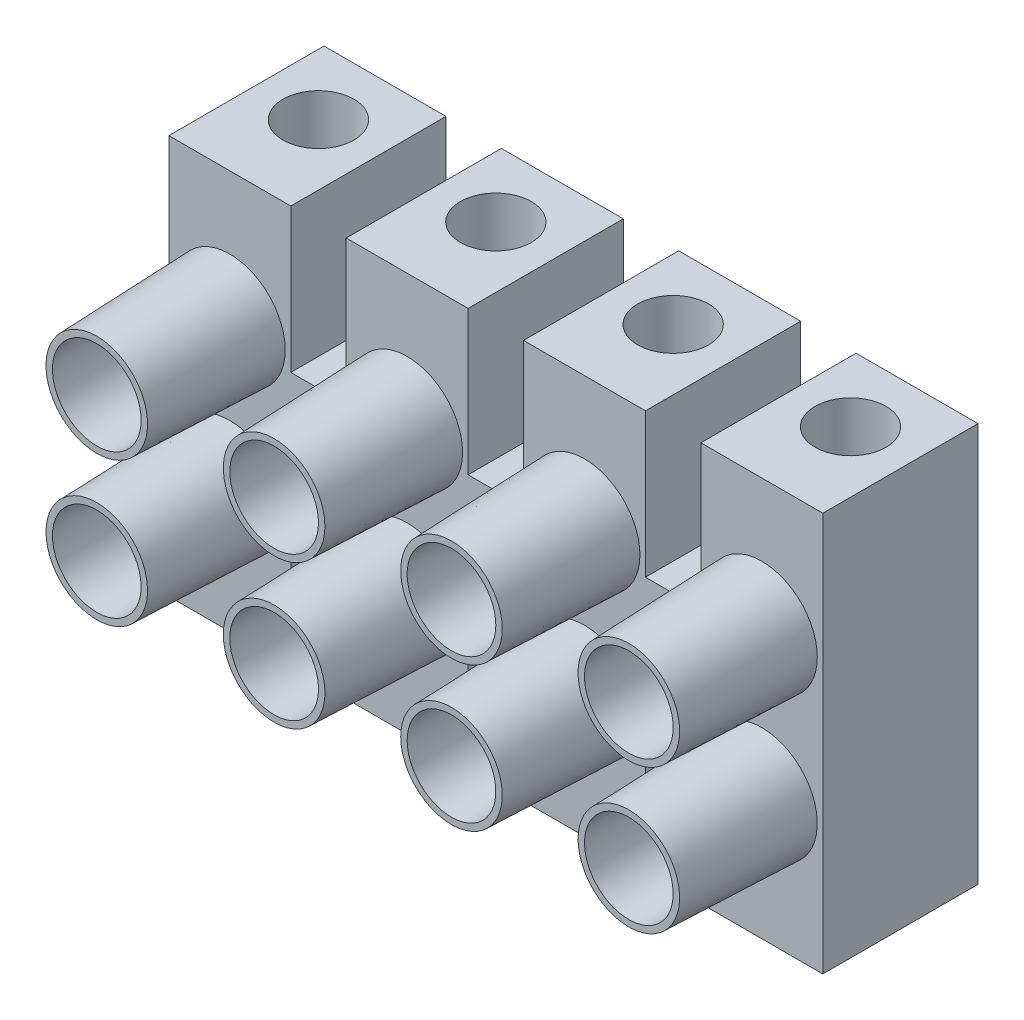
ISO-10303-21;
HEADER;
FILE_DESCRIPTION(('STEP AP214'),'2;1');
FILE_NAME('part.step','',(''),(''),'','','');
FILE_SCHEMA(('AUTOMOTIVE_DESIGN { 1 0 10303 214 1 1 1 1 }'));
ENDSEC;
DATA;
#1=APPLICATION_CONTEXT('core data for automotive mechanical design processes');
#2=APPLICATION_PROTOCOL_DEFINITION('international standard','automotive_design',2000,#1);
#3=PRODUCT_CONTEXT('',#1,'mechanical');
#4=PRODUCT('Part','Part','',(#3));
#5=PRODUCT_RELATED_PRODUCT_CATEGORY('part','',(#4));
#6=PRODUCT_DEFINITION_FORMATION('','',#4);
#7=PRODUCT_DEFINITION_CONTEXT('part definition',#1,'design');
#8=PRODUCT_DEFINITION('design','',#6,#7);
#9=PRODUCT_DEFINITION_SHAPE('','',#8);
#10=(LENGTH_UNIT() NAMED_UNIT(*) SI_UNIT(.MILLI.,.METRE.));
#11=(NAMED_UNIT(*) PLANE_ANGLE_UNIT() SI_UNIT($,.RADIAN.));
#12=(NAMED_UNIT(*) SI_UNIT($,.STERADIAN.) SOLID_ANGLE_UNIT());
#13=UNCERTAINTY_MEASURE_WITH_UNIT(LENGTH_MEASURE(1.E-05),#10,'distance_accuracy_value','');
#14=(GEOMETRIC_REPRESENTATION_CONTEXT(3) GLOBAL_UNCERTAINTY_ASSIGNED_CONTEXT((#13)) GLOBAL_UNIT_ASSIGNED_CONTEXT((#10,
#11,#12)) REPRESENTATION_CONTEXT('',''));
#15=CARTESIAN_POINT('',(0.,0.,0.));
#16=DIRECTION('',(0.,0.,1.));
#17=DIRECTION('',(1.,0.,0.));
#18=AXIS2_PLACEMENT_3D('',#15,#16,#17);
#19=CARTESIAN_POINT('',(0.,-9.,7.));
#20=DIRECTION('',(0.,0.,1.));
#21=DIRECTION('',(1.,0.,0.));
#22=AXIS2_PLACEMENT_3D('',#19,#20,#21);
#23=PLANE('',#22);
#24=CARTESIAN_POINT('',(14.75,0.,7.));
#25=DIRECTION('',(0.,0.,1.));
#26=DIRECTION('',(1.,0.,0.));
#27=AXIS2_PLACEMENT_3D('',#24,#25,#26);
#28=CIRCLE('',#27,1.6);
#29=CARTESIAN_POINT('',(16.35,0.,7.));
#30=VERTEX_POINT('',#29);
#31=EDGE_CURVE('E500',#30,#30,#28,.T.);
#32=ORIENTED_EDGE('',*,*,#31,.F.);
#33=EDGE_LOOP('',(#32));
#34=FACE_BOUND('',#33,.T.);
#35=DIRECTION('',(0.,-1.,0.));
#36=VECTOR('',#35,1.);
#37=CARTESIAN_POINT('',(0.,2.5,7.));
#38=LINE('',#37,#36);
#39=CARTESIAN_POINT('',(0.,9.,7.));
#40=VERTEX_POINT('',#39);
#41=CARTESIAN_POINT('',(0.,-9.,7.));
#42=VERTEX_POINT('',#41);
#43=EDGE_CURVE('E44',#40,#42,#38,.T.);
#44=ORIENTED_EDGE('',*,*,#43,.T.);
#45=DIRECTION('',(1.,0.,0.));
#46=VECTOR('',#45,1.);
#47=CARTESIAN_POINT('',(0.,-9.,7.));
#48=LINE('',#47,#46);
#49=CARTESIAN_POINT('',(5.5,-9.,7.));
#50=VERTEX_POINT('',#49);
#51=EDGE_CURVE('E230',#42,#50,#48,.T.);
#52=ORIENTED_EDGE('',*,*,#51,.T.);
#53=DIRECTION('',(0.,1.,0.));
#54=VECTOR('',#53,1.);
#55=CARTESIAN_POINT('',(5.5,-9.,7.));
#56=LINE('',#55,#54);
#57=CARTESIAN_POINT('',(5.5,-2.5,7.));
#58=VERTEX_POINT('',#57);
#59=EDGE_CURVE('E298',#50,#58,#56,.T.);
#60=ORIENTED_EDGE('',*,*,#59,.T.);
#61=DIRECTION('',(1.,0.,0.));
#62=VECTOR('',#61,1.);
#63=CARTESIAN_POINT('',(5.5,-2.5,7.));
#64=LINE('',#63,#62);
#65=CARTESIAN_POINT('',(8.,-2.5,7.));
#66=VERTEX_POINT('',#65);
#67=EDGE_CURVE('E300',#58,#66,#64,.T.);
#68=ORIENTED_EDGE('',*,*,#67,.T.);
#69=DIRECTION('',(0.,-1.,0.));
#70=VECTOR('',#69,1.);
#71=CARTESIAN_POINT('',(8.,-2.5,7.));
#72=LINE('',#71,#70);
#73=CARTESIAN_POINT('',(8.,-9.,7.));
#74=VERTEX_POINT('',#73);
#75=EDGE_CURVE('E302',#66,#74,#72,.T.);
#76=ORIENTED_EDGE('',*,*,#75,.T.);
#77=DIRECTION('',(1.,0.,0.));
#78=VECTOR('',#77,1.);
#79=CARTESIAN_POINT('',(8.,-9.,7.));
#80=LINE('',#79,#78);
#81=CARTESIAN_POINT('',(13.5,-9.,7.));
#82=VERTEX_POINT('',#81);
#83=EDGE_CURVE('E304',#74,#82,#80,.T.);
#84=ORIENTED_EDGE('',*,*,#83,.T.);
#85=DIRECTION('',(0.,1.,0.));
#86=VECTOR('',#85,1.);
#87=CARTESIAN_POINT('',(13.5,-9.,7.));
#88=LINE('',#87,#86);
#89=CARTESIAN_POINT('',(13.5,-2.5,7.));
#90=VERTEX_POINT('',#89);
#91=EDGE_CURVE('E306',#82,#90,#88,.T.);
#92=ORIENTED_EDGE('',*,*,#91,.T.);
#93=DIRECTION('',(1.,0.,0.));
#94=VECTOR('',#93,1.);
#95=CARTESIAN_POINT('',(13.5,-2.5,7.));
#96=LINE('',#95,#94);
#97=CARTESIAN_POINT('',(16.,-2.5,7.));
#98=VERTEX_POINT('',#97);
#99=EDGE_CURVE('E308',#90,#98,#96,.T.);
#100=ORIENTED_EDGE('',*,*,#99,.T.);
#101=DIRECTION('',(0.,-1.,0.));
#102=VECTOR('',#101,1.);
#103=CARTESIAN_POINT('',(16.,-2.5,7.));
#104=LINE('',#103,#102);
#105=CARTESIAN_POINT('',(16.,-9.,7.));
#106=VERTEX_POINT('',#105);
#107=EDGE_CURVE('E310',#98,#106,#104,.T.);
#108=ORIENTED_EDGE('',*,*,#107,.T.);
#109=DIRECTION('',(1.,0.,0.));
#110=VECTOR('',#109,1.);
#111=CARTESIAN_POINT('',(16.,-9.,7.));
#112=LINE('',#111,#110);
#113=CARTESIAN_POINT('',(21.5,-9.,7.));
#114=VERTEX_POINT('',#113);
#115=EDGE_CURVE('E312',#106,#114,#112,.T.);
#116=ORIENTED_EDGE('',*,*,#115,.T.);
#117=DIRECTION('',(0.,1.,0.));
#118=VECTOR('',#117,1.);
#119=CARTESIAN_POINT('',(21.5,-9.,7.));
#120=LINE('',#119,#118);
#121=CARTESIAN_POINT('',(21.5,-2.5,7.));
#122=VERTEX_POINT('',#121);
#123=EDGE_CURVE('E314',#114,#122,#120,.T.);
#124=ORIENTED_EDGE('',*,*,#123,.T.);
#125=DIRECTION('',(1.,0.,0.));
#126=VECTOR('',#125,1.);
#127=CARTESIAN_POINT('',(21.5,-2.5,7.));
#128=LINE('',#127,#126);
#129=CARTESIAN_POINT('',(24.,-2.5,7.));
#130=VERTEX_POINT('',#129);
#131=EDGE_CURVE('E316',#122,#130,#128,.T.);
#132=ORIENTED_EDGE('',*,*,#131,.T.);
#133=DIRECTION('',(0.,-1.,0.));
#134=VECTOR('',#133,1.);
#135=CARTESIAN_POINT('',(24.,-2.5,7.));
#136=LINE('',#135,#134);
#137=CARTESIAN_POINT('',(24.,-9.,7.));
#138=VERTEX_POINT('',#137);
#139=EDGE_CURVE('E318',#130,#138,#136,.T.);
#140=ORIENTED_EDGE('',*,*,#139,.T.);
#141=DIRECTION('',(1.,0.,0.));
#142=VECTOR('',#141,1.);
#143=CARTESIAN_POINT('',(24.,-9.,7.));
#144=LINE('',#143,#142);
#145=CARTESIAN_POINT('',(29.5,-9.,7.));
#146=VERTEX_POINT('',#145);
#147=EDGE_CURVE('E320',#138,#146,#144,.T.);
#148=ORIENTED_EDGE('',*,*,#147,.T.);
#149=DIRECTION('',(0.,1.,0.));
#150=VECTOR('',#149,1.);
#151=CARTESIAN_POINT('',(29.5,-9.,7.));
#152=LINE('',#151,#150);
#153=CARTESIAN_POINT('',(29.5,9.,7.));
#154=VERTEX_POINT('',#153);
#155=EDGE_CURVE('E322',#146,#154,#152,.T.);
#156=ORIENTED_EDGE('',*,*,#155,.T.);
#157=DIRECTION('',(-1.,0.,0.));
#158=VECTOR('',#157,1.);
#159=CARTESIAN_POINT('',(24.,9.,7.));
#160=LINE('',#159,#158);
#161=CARTESIAN_POINT('',(24.,9.,7.));
#162=VERTEX_POINT('',#161);
#163=EDGE_CURVE('E324',#154,#162,#160,.T.);
#164=ORIENTED_EDGE('',*,*,#163,.T.);
#165=DIRECTION('',(0.,-1.,0.));
#166=VECTOR('',#165,1.);
#167=CARTESIAN_POINT('',(24.,2.5,7.));
#168=LINE('',#167,#166);
#169=CARTESIAN_POINT('',(24.,2.5,7.));
#170=VERTEX_POINT('',#169);
#171=EDGE_CURVE('E326',#162,#170,#168,.T.);
#172=ORIENTED_EDGE('',*,*,#171,.T.);
#173=DIRECTION('',(-1.,0.,0.));
#174=VECTOR('',#173,1.);
#175=CARTESIAN_POINT('',(21.5,2.5,7.));
#176=LINE('',#175,#174);
#177=CARTESIAN_POINT('',(21.5,2.5,7.));
#178=VERTEX_POINT('',#177);
#179=EDGE_CURVE('E328',#170,#178,#176,.T.);
#180=ORIENTED_EDGE('',*,*,#179,.T.);
#181=DIRECTION('',(0.,1.,0.));
#182=VECTOR('',#181,1.);
#183=CARTESIAN_POINT('',(21.5,9.,7.));
#184=LINE('',#183,#182);
#185=CARTESIAN_POINT('',(21.5,9.,7.));
#186=VERTEX_POINT('',#185);
#187=EDGE_CURVE('E330',#178,#186,#184,.T.);
#188=ORIENTED_EDGE('',*,*,#187,.T.);
#189=DIRECTION('',(-1.,0.,0.));
#190=VECTOR('',#189,1.);
#191=CARTESIAN_POINT('',(16.,9.,7.));
#192=LINE('',#191,#190);
#193=CARTESIAN_POINT('',(16.,9.,7.));
#194=VERTEX_POINT('',#193);
#195=EDGE_CURVE('E332',#186,#194,#192,.T.);
#196=ORIENTED_EDGE('',*,*,#195,.T.);
#197=DIRECTION('',(0.,-1.,0.));
#198=VECTOR('',#197,1.);
#199=CARTESIAN_POINT('',(16.,2.5,7.));
#200=LINE('',#199,#198);
#201=CARTESIAN_POINT('',(16.,2.5,7.));
#202=VERTEX_POINT('',#201);
#203=EDGE_CURVE('E334',#194,#202,#200,.T.);
#204=ORIENTED_EDGE('',*,*,#203,.T.);
#205=DIRECTION('',(-1.,0.,0.));
#206=VECTOR('',#205,1.);
#207=CARTESIAN_POINT('',(13.5,2.5,7.));
#208=LINE('',#207,#206);
#209=CARTESIAN_POINT('',(13.5,2.5,7.));
#210=VERTEX_POINT('',#209);
#211=EDGE_CURVE('E336',#202,#210,#208,.T.);
#212=ORIENTED_EDGE('',*,*,#211,.T.);
#213=DIRECTION('',(0.,1.,0.));
#214=VECTOR('',#213,1.);
#215=CARTESIAN_POINT('',(13.5,9.,7.));
#216=LINE('',#215,#214);
#217=CARTESIAN_POINT('',(13.5,9.,7.));
#218=VERTEX_POINT('',#217);
#219=EDGE_CURVE('E338',#210,#218,#216,.T.);
#220=ORIENTED_EDGE('',*,*,#219,.T.);
#221=DIRECTION('',(-1.,0.,0.));
#222=VECTOR('',#221,1.);
#223=CARTESIAN_POINT('',(8.,9.,7.));
#224=LINE('',#223,#222);
#225=CARTESIAN_POINT('',(8.,9.,7.));
#226=VERTEX_POINT('',#225);
#227=EDGE_CURVE('E340',#218,#226,#224,.T.);
#228=ORIENTED_EDGE('',*,*,#227,.T.);
#229=DIRECTION('',(0.,-1.,0.));
#230=VECTOR('',#229,1.);
#231=CARTESIAN_POINT('',(8.,2.5,7.));
#232=LINE('',#231,#230);
#233=CARTESIAN_POINT('',(8.,2.5,7.));
#234=VERTEX_POINT('',#233);
#235=EDGE_CURVE('E342',#226,#234,#232,.T.);
#236=ORIENTED_EDGE('',*,*,#235,.T.);
#237=DIRECTION('',(-1.,0.,0.));
#238=VECTOR('',#237,1.);
#239=CARTESIAN_POINT('',(5.5,2.5,7.));
#240=LINE('',#239,#238);
#241=CARTESIAN_POINT('',(5.5,2.5,7.));
#242=VERTEX_POINT('',#241);
#243=EDGE_CURVE('E344',#234,#242,#240,.T.);
#244=ORIENTED_EDGE('',*,*,#243,.T.);
#245=DIRECTION('',(0.,1.,0.));
#246=VECTOR('',#245,1.);
#247=CARTESIAN_POINT('',(5.5,9.,7.));
#248=LINE('',#247,#246);
#249=CARTESIAN_POINT('',(5.5,9.,7.));
#250=VERTEX_POINT('',#249);
#251=EDGE_CURVE('E51',#242,#250,#248,.T.);
#252=ORIENTED_EDGE('',*,*,#251,.T.);
#253=DIRECTION('',(-1.,0.,0.));
#254=VECTOR('',#253,1.);
#255=CARTESIAN_POINT('',(0.,9.,7.));
#256=LINE('',#255,#254);
#257=EDGE_CURVE('E347',#250,#40,#256,.T.);
#258=ORIENTED_EDGE('',*,*,#257,.T.);
#259=EDGE_LOOP('',(#44,#52,#60,#68,#76,#84,#92,#100,#108,#116,#124,#132,#140,#148,#156,#164,
#172,#180,#188,#196,#204,#212,#220,#228,#236,#244,#252,#258));
#260=FACE_BOUND('',#259,.T.);
#261=CARTESIAN_POINT('',(6.75,0.,7.));
#262=DIRECTION('',(0.,0.,1.));
#263=DIRECTION('',(1.,0.,0.));
#264=AXIS2_PLACEMENT_3D('',#261,#262,#263);
#265=CIRCLE('',#264,1.6);
#266=CARTESIAN_POINT('',(8.35,0.,7.));
#267=VERTEX_POINT('',#266);
#268=EDGE_CURVE('E239',#267,#267,#265,.T.);
#269=ORIENTED_EDGE('',*,*,#268,.F.);
#270=EDGE_LOOP('',(#269));
#271=FACE_BOUND('',#270,.T.);
#272=CARTESIAN_POINT('',(22.75,0.,7.));
#273=DIRECTION('',(0.,0.,1.));
#274=DIRECTION('',(1.,0.,0.));
#275=AXIS2_PLACEMENT_3D('',#272,#273,#274);
#276=CIRCLE('',#275,1.6);
#277=CARTESIAN_POINT('',(24.35,0.,7.));
#278=VERTEX_POINT('',#277);
#279=EDGE_CURVE('E494',#278,#278,#276,.T.);
#280=ORIENTED_EDGE('',*,*,#279,.F.);
#281=EDGE_LOOP('',(#280));
#282=FACE_BOUND('',#281,.T.);
#283=CARTESIAN_POINT('',(2.75,3.25,7.));
#284=DIRECTION('',(0.,0.,1.));
#285=DIRECTION('',(1.,0.,0.));
#286=AXIS2_PLACEMENT_3D('',#283,#284,#285);
#287=CIRCLE('',#286,2.5);
#288=CARTESIAN_POINT('',(5.25,3.25,7.));
#289=VERTEX_POINT('',#288);
#290=EDGE_CURVE('E449',#289,#289,#287,.T.);
#291=ORIENTED_EDGE('',*,*,#290,.F.);
#292=EDGE_LOOP('',(#291));
#293=FACE_BOUND('',#292,.T.);
#294=CARTESIAN_POINT('',(10.75,3.25,7.));
#295=DIRECTION('',(0.,0.,1.));
#296=DIRECTION('',(1.,0.,0.));
#297=AXIS2_PLACEMENT_3D('',#294,#295,#296);
#298=CIRCLE('',#297,2.5);
#299=CARTESIAN_POINT('',(13.25,3.25,7.));
#300=VERTEX_POINT('',#299);
#301=EDGE_CURVE('E477',#300,#300,#298,.T.);
#302=ORIENTED_EDGE('',*,*,#301,.F.);
#303=EDGE_LOOP('',(#302));
#304=FACE_BOUND('',#303,.T.);
#305=CARTESIAN_POINT('',(18.75,3.25,7.));
#306=DIRECTION('',(0.,0.,1.));
#307=DIRECTION('',(1.,0.,0.));
#308=AXIS2_PLACEMENT_3D('',#305,#306,#307);
#309=CIRCLE('',#308,2.5);
#310=CARTESIAN_POINT('',(21.25,3.25,7.));
#311=VERTEX_POINT('',#310);
#312=EDGE_CURVE('E464',#311,#311,#309,.T.);
#313=ORIENTED_EDGE('',*,*,#312,.F.);
#314=EDGE_LOOP('',(#313));
#315=FACE_BOUND('',#314,.T.);
#316=CARTESIAN_POINT('',(26.75,3.25,7.));
#317=DIRECTION('',(0.,0.,1.));
#318=DIRECTION('',(1.,0.,0.));
#319=AXIS2_PLACEMENT_3D('',#316,#317,#318);
#320=CIRCLE('',#319,2.5);
#321=CARTESIAN_POINT('',(29.25,3.25,7.));
#322=VERTEX_POINT('',#321);
#323=EDGE_CURVE('E459',#322,#322,#320,.T.);
#324=ORIENTED_EDGE('',*,*,#323,.F.);
#325=EDGE_LOOP('',(#324));
#326=FACE_BOUND('',#325,.T.);
#327=CARTESIAN_POINT('',(26.75,-3.25,7.));
#328=DIRECTION('',(0.,0.,1.));
#329=DIRECTION('',(-1.,0.,0.));
#330=AXIS2_PLACEMENT_3D('',#327,#328,#329);
#331=CIRCLE('',#330,2.5);
#332=CARTESIAN_POINT('',(24.25,-3.25,7.));
#333=VERTEX_POINT('',#332);
#334=EDGE_CURVE('E454',#333,#333,#331,.T.);
#335=ORIENTED_EDGE('',*,*,#334,.F.);
#336=EDGE_LOOP('',(#335));
#337=FACE_BOUND('',#336,.T.);
#338=CARTESIAN_POINT('',(18.75,-3.25,7.));
#339=DIRECTION('',(0.,0.,1.));
#340=DIRECTION('',(-1.,0.,0.));
#341=AXIS2_PLACEMENT_3D('',#338,#339,#340);
#342=CIRCLE('',#341,2.5);
#343=CARTESIAN_POINT('',(16.25,-3.25,7.));
#344=VERTEX_POINT('',#343);
#345=EDGE_CURVE('E469',#344,#344,#342,.T.);
#346=ORIENTED_EDGE('',*,*,#345,.F.);
#347=EDGE_LOOP('',(#346));
#348=FACE_BOUND('',#347,.T.);
#349=CARTESIAN_POINT('',(10.75,-3.25,7.));
#350=DIRECTION('',(0.,0.,1.));
#351=DIRECTION('',(-1.,0.,0.));
#352=AXIS2_PLACEMENT_3D('',#349,#350,#351);
#353=CIRCLE('',#352,2.5);
#354=CARTESIAN_POINT('',(8.25,-3.25,7.));
#355=VERTEX_POINT('',#354);
#356=EDGE_CURVE('E473',#355,#355,#353,.T.);
#357=ORIENTED_EDGE('',*,*,#356,.F.);
#358=EDGE_LOOP('',(#357));
#359=FACE_BOUND('',#358,.T.);
#360=CARTESIAN_POINT('',(2.75,-3.25,7.));
#361=DIRECTION('',(0.,0.,1.));
#362=DIRECTION('',(-1.,0.,0.));
#363=AXIS2_PLACEMENT_3D('',#360,#361,#362);
#364=CIRCLE('',#363,2.5);
#365=CARTESIAN_POINT('',(0.249999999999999,-3.25,7.));
#366=VERTEX_POINT('',#365);
#367=EDGE_CURVE('E681',#366,#366,#364,.T.);
#368=ORIENTED_EDGE('',*,*,#367,.F.);
#369=EDGE_LOOP('',(#368));
#370=FACE_BOUND('',#369,.T.);
#371=ADVANCED_FACE('F27',(#34,#260,#271,#282,#293,#304,#315,#326,#337,#348,#359,#370),#23,.T.);
#372=CARTESIAN_POINT('',(0.,-9.,0.));
#373=DIRECTION('',(0.,0.,1.));
#374=DIRECTION('',(1.,0.,0.));
#375=AXIS2_PLACEMENT_3D('',#372,#373,#374);
#376=PLANE('',#375);
#377=CARTESIAN_POINT('',(14.75,0.,0.));
#378=DIRECTION('',(0.,0.,1.));
#379=DIRECTION('',(1.,0.,0.));
#380=AXIS2_PLACEMENT_3D('',#377,#378,#379);
#381=CIRCLE('',#380,1.6);
#382=CARTESIAN_POINT('',(16.35,0.,0.));
#383=VERTEX_POINT('',#382);
#384=EDGE_CURVE('E497',#383,#383,#381,.T.);
#385=ORIENTED_EDGE('',*,*,#384,.T.);
#386=EDGE_LOOP('',(#385));
#387=FACE_BOUND('',#386,.T.);
#388=DIRECTION('',(1.,0.,0.));
#389=VECTOR('',#388,1.);
#390=CARTESIAN_POINT('',(0.,-9.,0.));
#391=LINE('',#390,#389);
#392=CARTESIAN_POINT('',(0.,-9.,0.));
#393=VERTEX_POINT('',#392);
#394=CARTESIAN_POINT('',(5.5,-9.,0.));
#395=VERTEX_POINT('',#394);
#396=EDGE_CURVE('E228',#393,#395,#391,.T.);
#397=ORIENTED_EDGE('',*,*,#396,.F.);
#398=DIRECTION('',(0.,-1.,0.));
#399=VECTOR('',#398,1.);
#400=CARTESIAN_POINT('',(0.,2.5,0.));
#401=LINE('',#400,#399);
#402=CARTESIAN_POINT('',(0.,9.,0.));
#403=VERTEX_POINT('',#402);
#404=EDGE_CURVE('E213',#403,#393,#401,.T.);
#405=ORIENTED_EDGE('',*,*,#404,.F.);
#406=DIRECTION('',(-1.,0.,0.));
#407=VECTOR('',#406,1.);
#408=CARTESIAN_POINT('',(0.,9.,0.));
#409=LINE('',#408,#407);
#410=CARTESIAN_POINT('',(5.5,9.,0.));
#411=VERTEX_POINT('',#410);
#412=EDGE_CURVE('E223',#411,#403,#409,.T.);
#413=ORIENTED_EDGE('',*,*,#412,.F.);
#414=DIRECTION('',(0.,1.,0.));
#415=VECTOR('',#414,1.);
#416=CARTESIAN_POINT('',(5.5,9.,0.));
#417=LINE('',#416,#415);
#418=CARTESIAN_POINT('',(5.5,2.5,0.));
#419=VERTEX_POINT('',#418);
#420=EDGE_CURVE('E293',#419,#411,#417,.T.);
#421=ORIENTED_EDGE('',*,*,#420,.F.);
#422=DIRECTION('',(-1.,0.,0.));
#423=VECTOR('',#422,1.);
#424=CARTESIAN_POINT('',(5.5,2.5,0.));
#425=LINE('',#424,#423);
#426=CARTESIAN_POINT('',(8.,2.5,0.));
#427=VERTEX_POINT('',#426);
#428=EDGE_CURVE('E291',#427,#419,#425,.T.);
#429=ORIENTED_EDGE('',*,*,#428,.F.);
#430=DIRECTION('',(0.,-1.,0.));
#431=VECTOR('',#430,1.);
#432=CARTESIAN_POINT('',(8.,2.5,0.));
#433=LINE('',#432,#431);
#434=CARTESIAN_POINT('',(8.,9.,0.));
#435=VERTEX_POINT('',#434);
#436=EDGE_CURVE('E289',#435,#427,#433,.T.);
#437=ORIENTED_EDGE('',*,*,#436,.F.);
#438=DIRECTION('',(-1.,0.,0.));
#439=VECTOR('',#438,1.);
#440=CARTESIAN_POINT('',(8.,9.,0.));
#441=LINE('',#440,#439);
#442=CARTESIAN_POINT('',(13.5,9.,0.));
#443=VERTEX_POINT('',#442);
#444=EDGE_CURVE('E287',#443,#435,#441,.T.);
#445=ORIENTED_EDGE('',*,*,#444,.F.);
#446=DIRECTION('',(0.,1.,0.));
#447=VECTOR('',#446,1.);
#448=CARTESIAN_POINT('',(13.5,9.,0.));
#449=LINE('',#448,#447);
#450=CARTESIAN_POINT('',(13.5,2.5,0.));
#451=VERTEX_POINT('',#450);
#452=EDGE_CURVE('E285',#451,#443,#449,.T.);
#453=ORIENTED_EDGE('',*,*,#452,.F.);
#454=DIRECTION('',(-1.,0.,0.));
#455=VECTOR('',#454,1.);
#456=CARTESIAN_POINT('',(13.5,2.5,0.));
#457=LINE('',#456,#455);
#458=CARTESIAN_POINT('',(16.,2.5,0.));
#459=VERTEX_POINT('',#458);
#460=EDGE_CURVE('E283',#459,#451,#457,.T.);
#461=ORIENTED_EDGE('',*,*,#460,.F.);
#462=DIRECTION('',(0.,-1.,0.));
#463=VECTOR('',#462,1.);
#464=CARTESIAN_POINT('',(16.,2.5,0.));
#465=LINE('',#464,#463);
#466=CARTESIAN_POINT('',(16.,9.,0.));
#467=VERTEX_POINT('',#466);
#468=EDGE_CURVE('E281',#467,#459,#465,.T.);
#469=ORIENTED_EDGE('',*,*,#468,.F.);
#470=DIRECTION('',(-1.,0.,0.));
#471=VECTOR('',#470,1.);
#472=CARTESIAN_POINT('',(16.,9.,0.));
#473=LINE('',#472,#471);
#474=CARTESIAN_POINT('',(21.5,9.,0.));
#475=VERTEX_POINT('',#474);
#476=EDGE_CURVE('E279',#475,#467,#473,.T.);
#477=ORIENTED_EDGE('',*,*,#476,.F.);
#478=DIRECTION('',(0.,1.,0.));
#479=VECTOR('',#478,1.);
#480=CARTESIAN_POINT('',(21.5,9.,0.));
#481=LINE('',#480,#479);
#482=CARTESIAN_POINT('',(21.5,2.5,0.));
#483=VERTEX_POINT('',#482);
#484=EDGE_CURVE('E277',#483,#475,#481,.T.);
#485=ORIENTED_EDGE('',*,*,#484,.F.);
#486=DIRECTION('',(-1.,0.,0.));
#487=VECTOR('',#486,1.);
#488=CARTESIAN_POINT('',(21.5,2.5,0.));
#489=LINE('',#488,#487);
#490=CARTESIAN_POINT('',(24.,2.5,0.));
#491=VERTEX_POINT('',#490);
#492=EDGE_CURVE('E275',#491,#483,#489,.T.);
#493=ORIENTED_EDGE('',*,*,#492,.F.);
#494=DIRECTION('',(0.,-1.,0.));
#495=VECTOR('',#494,1.);
#496=CARTESIAN_POINT('',(24.,2.5,0.));
#497=LINE('',#496,#495);
#498=CARTESIAN_POINT('',(24.,9.,0.));
#499=VERTEX_POINT('',#498);
#500=EDGE_CURVE('E273',#499,#491,#497,.T.);
#501=ORIENTED_EDGE('',*,*,#500,.F.);
#502=DIRECTION('',(-1.,0.,0.));
#503=VECTOR('',#502,1.);
#504=CARTESIAN_POINT('',(24.,9.,0.));
#505=LINE('',#504,#503);
#506=CARTESIAN_POINT('',(29.5,9.,0.));
#507=VERTEX_POINT('',#506);
#508=EDGE_CURVE('E271',#507,#499,#505,.T.);
#509=ORIENTED_EDGE('',*,*,#508,.F.);
#510=DIRECTION('',(0.,1.,0.));
#511=VECTOR('',#510,1.);
#512=CARTESIAN_POINT('',(29.5,-9.,0.));
#513=LINE('',#512,#511);
#514=CARTESIAN_POINT('',(29.5,-9.,0.));
#515=VERTEX_POINT('',#514);
#516=EDGE_CURVE('E269',#515,#507,#513,.T.);
#517=ORIENTED_EDGE('',*,*,#516,.F.);
#518=DIRECTION('',(1.,0.,0.));
#519=VECTOR('',#518,1.);
#520=CARTESIAN_POINT('',(24.,-9.,0.));
#521=LINE('',#520,#519);
#522=CARTESIAN_POINT('',(24.,-9.,0.));
#523=VERTEX_POINT('',#522);
#524=EDGE_CURVE('E267',#523,#515,#521,.T.);
#525=ORIENTED_EDGE('',*,*,#524,.F.);
#526=DIRECTION('',(0.,-1.,0.));
#527=VECTOR('',#526,1.);
#528=CARTESIAN_POINT('',(24.,-2.5,0.));
#529=LINE('',#528,#527);
#530=CARTESIAN_POINT('',(24.,-2.5,0.));
#531=VERTEX_POINT('',#530);
#532=EDGE_CURVE('E265',#531,#523,#529,.T.);
#533=ORIENTED_EDGE('',*,*,#532,.F.);
#534=DIRECTION('',(1.,0.,0.));
#535=VECTOR('',#534,1.);
#536=CARTESIAN_POINT('',(21.5,-2.5,0.));
#537=LINE('',#536,#535);
#538=CARTESIAN_POINT('',(21.5,-2.5,0.));
#539=VERTEX_POINT('',#538);
#540=EDGE_CURVE('E263',#539,#531,#537,.T.);
#541=ORIENTED_EDGE('',*,*,#540,.F.);
#542=DIRECTION('',(0.,1.,0.));
#543=VECTOR('',#542,1.);
#544=CARTESIAN_POINT('',(21.5,-9.,0.));
#545=LINE('',#544,#543);
#546=CARTESIAN_POINT('',(21.5,-9.,0.));
#547=VERTEX_POINT('',#546);
#548=EDGE_CURVE('E261',#547,#539,#545,.T.);
#549=ORIENTED_EDGE('',*,*,#548,.F.);
#550=DIRECTION('',(1.,0.,0.));
#551=VECTOR('',#550,1.);
#552=CARTESIAN_POINT('',(16.,-9.,0.));
#553=LINE('',#552,#551);
#554=CARTESIAN_POINT('',(16.,-9.,0.));
#555=VERTEX_POINT('',#554);
#556=EDGE_CURVE('E259',#555,#547,#553,.T.);
#557=ORIENTED_EDGE('',*,*,#556,.F.);
#558=DIRECTION('',(0.,-1.,0.));
#559=VECTOR('',#558,1.);
#560=CARTESIAN_POINT('',(16.,-2.5,0.));
#561=LINE('',#560,#559);
#562=CARTESIAN_POINT('',(16.,-2.5,0.));
#563=VERTEX_POINT('',#562);
#564=EDGE_CURVE('E257',#563,#555,#561,.T.);
#565=ORIENTED_EDGE('',*,*,#564,.F.);
#566=DIRECTION('',(1.,0.,0.));
#567=VECTOR('',#566,1.);
#568=CARTESIAN_POINT('',(13.5,-2.5,0.));
#569=LINE('',#568,#567);
#570=CARTESIAN_POINT('',(13.5,-2.5,0.));
#571=VERTEX_POINT('',#570);
#572=EDGE_CURVE('E255',#571,#563,#569,.T.);
#573=ORIENTED_EDGE('',*,*,#572,.F.);
#574=DIRECTION('',(0.,1.,0.));
#575=VECTOR('',#574,1.);
#576=CARTESIAN_POINT('',(13.5,-9.,0.));
#577=LINE('',#576,#575);
#578=CARTESIAN_POINT('',(13.5,-9.,0.));
#579=VERTEX_POINT('',#578);
#580=EDGE_CURVE('E253',#579,#571,#577,.T.);
#581=ORIENTED_EDGE('',*,*,#580,.F.);
#582=DIRECTION('',(1.,0.,0.));
#583=VECTOR('',#582,1.);
#584=CARTESIAN_POINT('',(8.,-9.,0.));
#585=LINE('',#584,#583);
#586=CARTESIAN_POINT('',(8.,-9.,0.));
#587=VERTEX_POINT('',#586);
#588=EDGE_CURVE('E251',#587,#579,#585,.T.);
#589=ORIENTED_EDGE('',*,*,#588,.F.);
#590=DIRECTION('',(0.,-1.,0.));
#591=VECTOR('',#590,1.);
#592=CARTESIAN_POINT('',(8.,-2.5,0.));
#593=LINE('',#592,#591);
#594=CARTESIAN_POINT('',(8.,-2.5,0.));
#595=VERTEX_POINT('',#594);
#596=EDGE_CURVE('E249',#595,#587,#593,.T.);
#597=ORIENTED_EDGE('',*,*,#596,.F.);
#598=DIRECTION('',(1.,0.,0.));
#599=VECTOR('',#598,1.);
#600=CARTESIAN_POINT('',(5.5,-2.5,0.));
#601=LINE('',#600,#599);
#602=CARTESIAN_POINT('',(5.5,-2.5,0.));
#603=VERTEX_POINT('',#602);
#604=EDGE_CURVE('E241',#603,#595,#601,.T.);
#605=ORIENTED_EDGE('',*,*,#604,.F.);
#606=DIRECTION('',(0.,1.,0.));
#607=VECTOR('',#606,1.);
#608=CARTESIAN_POINT('',(5.5,-9.,0.));
#609=LINE('',#608,#607);
#610=EDGE_CURVE('E238',#395,#603,#609,.T.);
#611=ORIENTED_EDGE('',*,*,#610,.F.);
#612=EDGE_LOOP('',(#397,#405,#413,#421,#429,#437,#445,#453,#461,#469,#477,#485,#493,#501,#509,
#517,#525,#533,#541,#549,#557,#565,#573,#581,#589,#597,#605,#611));
#613=FACE_BOUND('',#612,.T.);
#614=CARTESIAN_POINT('',(6.75,0.,0.));
#615=DIRECTION('',(0.,0.,1.));
#616=DIRECTION('',(1.,0.,0.));
#617=AXIS2_PLACEMENT_3D('',#614,#615,#616);
#618=CIRCLE('',#617,1.6);
#619=CARTESIAN_POINT('',(8.35,0.,0.));
#620=VERTEX_POINT('',#619);
#621=EDGE_CURVE('E244',#620,#620,#618,.T.);
#622=ORIENTED_EDGE('',*,*,#621,.T.);
#623=EDGE_LOOP('',(#622));
#624=FACE_BOUND('',#623,.T.);
#625=CARTESIAN_POINT('',(22.75,0.,0.));
#626=DIRECTION('',(0.,0.,1.));
#627=DIRECTION('',(1.,0.,0.));
#628=AXIS2_PLACEMENT_3D('',#625,#626,#627);
#629=CIRCLE('',#628,1.6);
#630=CARTESIAN_POINT('',(24.35,0.,0.));
#631=VERTEX_POINT('',#630);
#632=EDGE_CURVE('E448',#631,#631,#629,.T.);
#633=ORIENTED_EDGE('',*,*,#632,.T.);
#634=EDGE_LOOP('',(#633));
#635=FACE_BOUND('',#634,.T.);
#636=ADVANCED_FACE('F235',(#387,#613,#624,#635),#376,.F.);
#637=CARTESIAN_POINT('',(0.,-9.,7.));
#638=DIRECTION('',(0.,1.,0.));
#639=DIRECTION('',(0.,0.,1.));
#640=AXIS2_PLACEMENT_3D('',#637,#638,#639);
#641=PLANE('',#640);
#642=CARTESIAN_POINT('',(2.75,-9.,3.));
#643=DIRECTION('',(0.,-1.,0.));
#644=DIRECTION('',(0.,0.,-1.));
#645=AXIS2_PLACEMENT_3D('',#642,#643,#644);
#646=CIRCLE('',#645,1.6);
#647=CARTESIAN_POINT('',(2.75,-9.,1.4));
#648=VERTEX_POINT('',#647);
#649=EDGE_CURVE('E1213',#648,#648,#646,.T.);
#650=ORIENTED_EDGE('',*,*,#649,.F.);
#651=EDGE_LOOP('',(#650));
#652=FACE_BOUND('',#651,.T.);
#653=ORIENTED_EDGE('',*,*,#396,.T.);
#654=DIRECTION('',(0.,0.,-1.));
#655=VECTOR('',#654,1.);
#656=CARTESIAN_POINT('',(5.5,-9.,7.));
#657=LINE('',#656,#655);
#658=EDGE_CURVE('E232',#50,#395,#657,.T.);
#659=ORIENTED_EDGE('',*,*,#658,.F.);
#660=ORIENTED_EDGE('',*,*,#51,.F.);
#661=DIRECTION('',(0.,0.,-1.));
#662=VECTOR('',#661,1.);
#663=CARTESIAN_POINT('',(0.,-9.,7.));
#664=LINE('',#663,#662);
#665=EDGE_CURVE('E216',#42,#393,#664,.T.);
#666=ORIENTED_EDGE('',*,*,#665,.T.);
#667=EDGE_LOOP('',(#653,#659,#660,#666));
#668=FACE_BOUND('',#667,.T.);
#669=ADVANCED_FACE('F226',(#652,#668),#641,.F.);
#670=CARTESIAN_POINT('',(5.5,-9.,7.));
#671=DIRECTION('',(-1.,0.,0.));
#672=DIRECTION('',(0.,0.,1.));
#673=AXIS2_PLACEMENT_3D('',#670,#671,#672);
#674=PLANE('',#673);
#675=ORIENTED_EDGE('',*,*,#610,.T.);
#676=DIRECTION('',(0.,0.,-1.));
#677=VECTOR('',#676,1.);
#678=CARTESIAN_POINT('',(5.5,-2.5,7.));
#679=LINE('',#678,#677);
#680=EDGE_CURVE('E422',#58,#603,#679,.T.);
#681=ORIENTED_EDGE('',*,*,#680,.F.);
#682=ORIENTED_EDGE('',*,*,#59,.F.);
#683=ORIENTED_EDGE('',*,*,#658,.T.);
#684=EDGE_LOOP('',(#675,#681,#682,#683));
#685=FACE_BOUND('',#684,.T.);
#686=ADVANCED_FACE('F772',(#685),#674,.F.);
#687=CARTESIAN_POINT('',(5.5,-2.5,7.));
#688=DIRECTION('',(0.,1.,0.));
#689=DIRECTION('',(-1.,0.,0.));
#690=AXIS2_PLACEMENT_3D('',#687,#688,#689);
#691=PLANE('',#690);
#692=ORIENTED_EDGE('',*,*,#604,.T.);
#693=DIRECTION('',(0.,0.,-1.));
#694=VECTOR('',#693,1.);
#695=CARTESIAN_POINT('',(8.,-2.5,7.));
#696=LINE('',#695,#694);
#697=EDGE_CURVE('E419',#66,#595,#696,.T.);
#698=ORIENTED_EDGE('',*,*,#697,.F.);
#699=ORIENTED_EDGE('',*,*,#67,.F.);
#700=ORIENTED_EDGE('',*,*,#680,.T.);
#701=EDGE_LOOP('',(#692,#698,#699,#700));
#702=FACE_BOUND('',#701,.T.);
#703=ADVANCED_FACE('F945',(#702),#691,.F.);
#704=CARTESIAN_POINT('',(8.,-2.5,7.));
#705=DIRECTION('',(1.,0.,0.));
#706=DIRECTION('',(0.,0.,-1.));
#707=AXIS2_PLACEMENT_3D('',#704,#705,#706);
#708=PLANE('',#707);
#709=ORIENTED_EDGE('',*,*,#596,.T.);
#710=DIRECTION('',(0.,0.,-1.));
#711=VECTOR('',#710,1.);
#712=CARTESIAN_POINT('',(8.,-9.,7.));
#713=LINE('',#712,#711);
#714=EDGE_CURVE('E416',#74,#587,#713,.T.);
#715=ORIENTED_EDGE('',*,*,#714,.F.);
#716=ORIENTED_EDGE('',*,*,#75,.F.);
#717=ORIENTED_EDGE('',*,*,#697,.T.);
#718=EDGE_LOOP('',(#709,#715,#716,#717));
#719=FACE_BOUND('',#718,.T.);
#720=ADVANCED_FACE('F784',(#719),#708,.F.);
#721=CARTESIAN_POINT('',(8.,-9.,7.));
#722=DIRECTION('',(0.,1.,0.));
#723=DIRECTION('',(0.,0.,1.));
#724=AXIS2_PLACEMENT_3D('',#721,#722,#723);
#725=PLANE('',#724);
#726=CARTESIAN_POINT('',(10.75,-9.,3.));
#727=DIRECTION('',(0.,-1.,0.));
#728=DIRECTION('',(0.,0.,-1.));
#729=AXIS2_PLACEMENT_3D('',#726,#727,#728);
#730=CIRCLE('',#729,1.6);
#731=CARTESIAN_POINT('',(10.75,-9.,1.4));
#732=VERTEX_POINT('',#731);
#733=EDGE_CURVE('E1207',#732,#732,#730,.T.);
#734=ORIENTED_EDGE('',*,*,#733,.F.);
#735=EDGE_LOOP('',(#734));
#736=FACE_BOUND('',#735,.T.);
#737=ORIENTED_EDGE('',*,*,#588,.T.);
#738=DIRECTION('',(0.,0.,-1.));
#739=VECTOR('',#738,1.);
#740=CARTESIAN_POINT('',(13.5,-9.,7.));
#741=LINE('',#740,#739);
#742=EDGE_CURVE('E413',#82,#579,#741,.T.);
#743=ORIENTED_EDGE('',*,*,#742,.F.);
#744=ORIENTED_EDGE('',*,*,#83,.F.);
#745=ORIENTED_EDGE('',*,*,#714,.T.);
#746=EDGE_LOOP('',(#737,#743,#744,#745));
#747=FACE_BOUND('',#746,.T.);
#748=ADVANCED_FACE('F779',(#736,#747),#725,.F.);
#749=CARTESIAN_POINT('',(13.5,-9.,7.));
#750=DIRECTION('',(-1.,0.,0.));
#751=DIRECTION('',(0.,0.,1.));
#752=AXIS2_PLACEMENT_3D('',#749,#750,#751);
#753=PLANE('',#752);
#754=ORIENTED_EDGE('',*,*,#580,.T.);
#755=DIRECTION('',(0.,0.,-1.));
#756=VECTOR('',#755,1.);
#757=CARTESIAN_POINT('',(13.5,-2.5,7.));
#758=LINE('',#757,#756);
#759=EDGE_CURVE('E410',#90,#571,#758,.T.);
#760=ORIENTED_EDGE('',*,*,#759,.F.);
#761=ORIENTED_EDGE('',*,*,#91,.F.);
#762=ORIENTED_EDGE('',*,*,#742,.T.);
#763=EDGE_LOOP('',(#754,#760,#761,#762));
#764=FACE_BOUND('',#763,.T.);
#765=ADVANCED_FACE('F783',(#764),#753,.F.);
#766=CARTESIAN_POINT('',(13.5,-2.5,7.));
#767=DIRECTION('',(0.,1.,0.));
#768=DIRECTION('',(-1.,0.,0.));
#769=AXIS2_PLACEMENT_3D('',#766,#767,#768);
#770=PLANE('',#769);
#771=ORIENTED_EDGE('',*,*,#572,.T.);
#772=DIRECTION('',(0.,0.,-1.));
#773=VECTOR('',#772,1.);
#774=CARTESIAN_POINT('',(16.,-2.5,7.));
#775=LINE('',#774,#773);
#776=EDGE_CURVE('E407',#98,#563,#775,.T.);
#777=ORIENTED_EDGE('',*,*,#776,.F.);
#778=ORIENTED_EDGE('',*,*,#99,.F.);
#779=ORIENTED_EDGE('',*,*,#759,.T.);
#780=EDGE_LOOP('',(#771,#777,#778,#779));
#781=FACE_BOUND('',#780,.T.);
#782=ADVANCED_FACE('F955',(#781),#770,.F.);
#783=CARTESIAN_POINT('',(16.,-2.5,7.));
#784=DIRECTION('',(1.,0.,0.));
#785=DIRECTION('',(0.,0.,-1.));
#786=AXIS2_PLACEMENT_3D('',#783,#784,#785);
#787=PLANE('',#786);
#788=ORIENTED_EDGE('',*,*,#564,.T.);
#789=DIRECTION('',(0.,0.,-1.));
#790=VECTOR('',#789,1.);
#791=CARTESIAN_POINT('',(16.,-9.,7.));
#792=LINE('',#791,#790);
#793=EDGE_CURVE('E404',#106,#555,#792,.T.);
#794=ORIENTED_EDGE('',*,*,#793,.F.);
#795=ORIENTED_EDGE('',*,*,#107,.F.);
#796=ORIENTED_EDGE('',*,*,#776,.T.);
#797=EDGE_LOOP('',(#788,#794,#795,#796));
#798=FACE_BOUND('',#797,.T.);
#799=ADVANCED_FACE('F796',(#798),#787,.F.);
#800=CARTESIAN_POINT('',(16.,-9.,7.));
#801=DIRECTION('',(0.,1.,0.));
#802=DIRECTION('',(0.,0.,1.));
#803=AXIS2_PLACEMENT_3D('',#800,#801,#802);
#804=PLANE('',#803);
#805=CARTESIAN_POINT('',(18.75,-9.,3.));
#806=DIRECTION('',(0.,-1.,0.));
#807=DIRECTION('',(0.,0.,-1.));
#808=AXIS2_PLACEMENT_3D('',#805,#806,#807);
#809=CIRCLE('',#808,1.6);
#810=CARTESIAN_POINT('',(18.75,-9.,1.4));
#811=VERTEX_POINT('',#810);
#812=EDGE_CURVE('E1199',#811,#811,#809,.T.);
#813=ORIENTED_EDGE('',*,*,#812,.F.);
#814=EDGE_LOOP('',(#813));
#815=FACE_BOUND('',#814,.T.);
#816=ORIENTED_EDGE('',*,*,#556,.T.);
#817=DIRECTION('',(0.,0.,-1.));
#818=VECTOR('',#817,1.);
#819=CARTESIAN_POINT('',(21.5,-9.,7.));
#820=LINE('',#819,#818);
#821=EDGE_CURVE('E401',#114,#547,#820,.T.);
#822=ORIENTED_EDGE('',*,*,#821,.F.);
#823=ORIENTED_EDGE('',*,*,#115,.F.);
#824=ORIENTED_EDGE('',*,*,#793,.T.);
#825=EDGE_LOOP('',(#816,#822,#823,#824));
#826=FACE_BOUND('',#825,.T.);
#827=ADVANCED_FACE('F791',(#815,#826),#804,.F.);
#828=CARTESIAN_POINT('',(21.5,-9.,7.));
#829=DIRECTION('',(-1.,0.,0.));
#830=DIRECTION('',(0.,0.,1.));
#831=AXIS2_PLACEMENT_3D('',#828,#829,#830);
#832=PLANE('',#831);
#833=ORIENTED_EDGE('',*,*,#548,.T.);
#834=DIRECTION('',(0.,0.,-1.));
#835=VECTOR('',#834,1.);
#836=CARTESIAN_POINT('',(21.5,-2.5,7.));
#837=LINE('',#836,#835);
#838=EDGE_CURVE('E398',#122,#539,#837,.T.);
#839=ORIENTED_EDGE('',*,*,#838,.F.);
#840=ORIENTED_EDGE('',*,*,#123,.F.);
#841=ORIENTED_EDGE('',*,*,#821,.T.);
#842=EDGE_LOOP('',(#833,#839,#840,#841));
#843=FACE_BOUND('',#842,.T.);
#844=ADVANCED_FACE('F795',(#843),#832,.F.);
#845=CARTESIAN_POINT('',(21.5,-2.5,7.));
#846=DIRECTION('',(0.,1.,0.));
#847=DIRECTION('',(-1.,0.,0.));
#848=AXIS2_PLACEMENT_3D('',#845,#846,#847);
#849=PLANE('',#848);
#850=ORIENTED_EDGE('',*,*,#540,.T.);
#851=DIRECTION('',(0.,0.,-1.));
#852=VECTOR('',#851,1.);
#853=CARTESIAN_POINT('',(24.,-2.5,7.));
#854=LINE('',#853,#852);
#855=EDGE_CURVE('E395',#130,#531,#854,.T.);
#856=ORIENTED_EDGE('',*,*,#855,.F.);
#857=ORIENTED_EDGE('',*,*,#131,.F.);
#858=ORIENTED_EDGE('',*,*,#838,.T.);
#859=EDGE_LOOP('',(#850,#856,#857,#858));
#860=FACE_BOUND('',#859,.T.);
#861=ADVANCED_FACE('F965',(#860),#849,.F.);
#862=CARTESIAN_POINT('',(24.,-2.5,7.));
#863=DIRECTION('',(1.,0.,0.));
#864=DIRECTION('',(0.,0.,-1.));
#865=AXIS2_PLACEMENT_3D('',#862,#863,#864);
#866=PLANE('',#865);
#867=ORIENTED_EDGE('',*,*,#532,.T.);
#868=DIRECTION('',(0.,0.,-1.));
#869=VECTOR('',#868,1.);
#870=CARTESIAN_POINT('',(24.,-9.,7.));
#871=LINE('',#870,#869);
#872=EDGE_CURVE('E392',#138,#523,#871,.T.);
#873=ORIENTED_EDGE('',*,*,#872,.F.);
#874=ORIENTED_EDGE('',*,*,#139,.F.);
#875=ORIENTED_EDGE('',*,*,#855,.T.);
#876=EDGE_LOOP('',(#867,#873,#874,#875));
#877=FACE_BOUND('',#876,.T.);
#878=ADVANCED_FACE('F808',(#877),#866,.F.);
#879=CARTESIAN_POINT('',(24.,-9.,7.));
#880=DIRECTION('',(0.,1.,0.));
#881=DIRECTION('',(0.,0.,1.));
#882=AXIS2_PLACEMENT_3D('',#879,#880,#881);
#883=PLANE('',#882);
#884=CARTESIAN_POINT('',(26.75,-9.,3.));
#885=DIRECTION('',(0.,-1.,0.));
#886=DIRECTION('',(0.,0.,-1.));
#887=AXIS2_PLACEMENT_3D('',#884,#885,#886);
#888=CIRCLE('',#887,1.6);
#889=CARTESIAN_POINT('',(26.75,-9.,1.4));
#890=VERTEX_POINT('',#889);
#891=EDGE_CURVE('E1197',#890,#890,#888,.T.);
#892=ORIENTED_EDGE('',*,*,#891,.F.);
#893=EDGE_LOOP('',(#892));
#894=FACE_BOUND('',#893,.T.);
#895=ORIENTED_EDGE('',*,*,#524,.T.);
#896=DIRECTION('',(0.,0.,-1.));
#897=VECTOR('',#896,1.);
#898=CARTESIAN_POINT('',(29.5,-9.,7.));
#899=LINE('',#898,#897);
#900=EDGE_CURVE('E389',#146,#515,#899,.T.);
#901=ORIENTED_EDGE('',*,*,#900,.F.);
#902=ORIENTED_EDGE('',*,*,#147,.F.);
#903=ORIENTED_EDGE('',*,*,#872,.T.);
#904=EDGE_LOOP('',(#895,#901,#902,#903));
#905=FACE_BOUND('',#904,.T.);
#906=ADVANCED_FACE('F803',(#894,#905),#883,.F.);
#907=CARTESIAN_POINT('',(29.5,-9.,7.));
#908=DIRECTION('',(-1.,0.,0.));
#909=DIRECTION('',(0.,0.,1.));
#910=AXIS2_PLACEMENT_3D('',#907,#908,#909);
#911=PLANE('',#910);
#912=ORIENTED_EDGE('',*,*,#516,.T.);
#913=DIRECTION('',(0.,0.,-1.));
#914=VECTOR('',#913,1.);
#915=CARTESIAN_POINT('',(29.5,9.,7.));
#916=LINE('',#915,#914);
#917=EDGE_CURVE('E386',#154,#507,#916,.T.);
#918=ORIENTED_EDGE('',*,*,#917,.F.);
#919=ORIENTED_EDGE('',*,*,#155,.F.);
#920=ORIENTED_EDGE('',*,*,#900,.T.);
#921=EDGE_LOOP('',(#912,#918,#919,#920));
#922=FACE_BOUND('',#921,.T.);
#923=ADVANCED_FACE('F807',(#922),#911,.F.);
#924=CARTESIAN_POINT('',(24.,9.,7.));
#925=DIRECTION('',(0.,-1.,0.));
#926=DIRECTION('',(0.,0.,-1.));
#927=AXIS2_PLACEMENT_3D('',#924,#925,#926);
#928=PLANE('',#927);
#929=CARTESIAN_POINT('',(26.75,9.,3.));
#930=DIRECTION('',(0.,-1.,0.));
#931=DIRECTION('',(0.,0.,-1.));
#932=AXIS2_PLACEMENT_3D('',#929,#930,#931);
#933=CIRCLE('',#932,1.6);
#934=CARTESIAN_POINT('',(26.75,9.,1.4));
#935=VERTEX_POINT('',#934);
#936=EDGE_CURVE('E1194',#935,#935,#933,.T.);
#937=ORIENTED_EDGE('',*,*,#936,.T.);
#938=EDGE_LOOP('',(#937));
#939=FACE_BOUND('',#938,.T.);
#940=ORIENTED_EDGE('',*,*,#508,.T.);
#941=DIRECTION('',(0.,0.,-1.));
#942=VECTOR('',#941,1.);
#943=CARTESIAN_POINT('',(24.,9.,7.));
#944=LINE('',#943,#942);
#945=EDGE_CURVE('E383',#162,#499,#944,.T.);
#946=ORIENTED_EDGE('',*,*,#945,.F.);
#947=ORIENTED_EDGE('',*,*,#163,.F.);
#948=ORIENTED_EDGE('',*,*,#917,.T.);
#949=EDGE_LOOP('',(#940,#946,#947,#948));
#950=FACE_BOUND('',#949,.T.);
#951=ADVANCED_FACE('F815',(#939,#950),#928,.F.);
#952=CARTESIAN_POINT('',(24.,2.5,7.));
#953=DIRECTION('',(1.,0.,0.));
#954=DIRECTION('',(0.,0.,-1.));
#955=AXIS2_PLACEMENT_3D('',#952,#953,#954);
#956=PLANE('',#955);
#957=ORIENTED_EDGE('',*,*,#500,.T.);
#958=DIRECTION('',(0.,0.,-1.));
#959=VECTOR('',#958,1.);
#960=CARTESIAN_POINT('',(24.,2.5,7.));
#961=LINE('',#960,#959);
#962=EDGE_CURVE('E380',#170,#491,#961,.T.);
#963=ORIENTED_EDGE('',*,*,#962,.F.);
#964=ORIENTED_EDGE('',*,*,#171,.F.);
#965=ORIENTED_EDGE('',*,*,#945,.T.);
#966=EDGE_LOOP('',(#957,#963,#964,#965));
#967=FACE_BOUND('',#966,.T.);
#968=ADVANCED_FACE('F819',(#967),#956,.F.);
#969=CARTESIAN_POINT('',(21.5,2.5,7.));
#970=DIRECTION('',(0.,-1.,0.));
#971=DIRECTION('',(1.,0.,0.));
#972=AXIS2_PLACEMENT_3D('',#969,#970,#971);
#973=PLANE('',#972);
#974=ORIENTED_EDGE('',*,*,#492,.T.);
#975=DIRECTION('',(0.,0.,-1.));
#976=VECTOR('',#975,1.);
#977=CARTESIAN_POINT('',(21.5,2.5,7.));
#978=LINE('',#977,#976);
#979=EDGE_CURVE('E377',#178,#483,#978,.T.);
#980=ORIENTED_EDGE('',*,*,#979,.F.);
#981=ORIENTED_EDGE('',*,*,#179,.F.);
#982=ORIENTED_EDGE('',*,*,#962,.T.);
#983=EDGE_LOOP('',(#974,#980,#981,#982));
#984=FACE_BOUND('',#983,.T.);
#985=ADVANCED_FACE('F978',(#984),#973,.F.);
#986=CARTESIAN_POINT('',(21.5,9.,7.));
#987=DIRECTION('',(-1.,0.,0.));
#988=DIRECTION('',(0.,0.,1.));
#989=AXIS2_PLACEMENT_3D('',#986,#987,#988);
#990=PLANE('',#989);
#991=ORIENTED_EDGE('',*,*,#484,.T.);
#992=DIRECTION('',(0.,0.,-1.));
#993=VECTOR('',#992,1.);
#994=CARTESIAN_POINT('',(21.5,9.,7.));
#995=LINE('',#994,#993);
#996=EDGE_CURVE('E374',#186,#475,#995,.T.);
#997=ORIENTED_EDGE('',*,*,#996,.F.);
#998=ORIENTED_EDGE('',*,*,#187,.F.);
#999=ORIENTED_EDGE('',*,*,#979,.T.);
#1000=EDGE_LOOP('',(#991,#997,#998,#999));
#1001=FACE_BOUND('',#1000,.T.);
#1002=ADVANCED_FACE('F830',(#1001),#990,.F.);
#1003=CARTESIAN_POINT('',(16.,9.,7.));
#1004=DIRECTION('',(0.,-1.,0.));
#1005=DIRECTION('',(0.,0.,-1.));
#1006=AXIS2_PLACEMENT_3D('',#1003,#1004,#1005);
#1007=PLANE('',#1006);
#1008=CARTESIAN_POINT('',(18.75,9.,3.));
#1009=DIRECTION('',(0.,-1.,0.));
#1010=DIRECTION('',(0.,0.,-1.));
#1011=AXIS2_PLACEMENT_3D('',#1008,#1009,#1010);
#1012=CIRCLE('',#1011,1.6);
#1013=CARTESIAN_POINT('',(18.75,9.,1.4));
#1014=VERTEX_POINT('',#1013);
#1015=EDGE_CURVE('E1204',#1014,#1014,#1012,.T.);
#1016=ORIENTED_EDGE('',*,*,#1015,.T.);
#1017=EDGE_LOOP('',(#1016));
#1018=FACE_BOUND('',#1017,.T.);
#1019=ORIENTED_EDGE('',*,*,#476,.T.);
#1020=DIRECTION('',(0.,0.,-1.));
#1021=VECTOR('',#1020,1.);
#1022=CARTESIAN_POINT('',(16.,9.,7.));
#1023=LINE('',#1022,#1021);
#1024=EDGE_CURVE('E371',#194,#467,#1023,.T.);
#1025=ORIENTED_EDGE('',*,*,#1024,.F.);
#1026=ORIENTED_EDGE('',*,*,#195,.F.);
#1027=ORIENTED_EDGE('',*,*,#996,.T.);
#1028=EDGE_LOOP('',(#1019,#1025,#1026,#1027));
#1029=FACE_BOUND('',#1028,.T.);
#1030=ADVANCED_FACE('F825',(#1018,#1029),#1007,.F.);
#1031=CARTESIAN_POINT('',(16.,2.5,7.));
#1032=DIRECTION('',(1.,0.,0.));
#1033=DIRECTION('',(0.,0.,-1.));
#1034=AXIS2_PLACEMENT_3D('',#1031,#1032,#1033);
#1035=PLANE('',#1034);
#1036=ORIENTED_EDGE('',*,*,#468,.T.);
#1037=DIRECTION('',(0.,0.,-1.));
#1038=VECTOR('',#1037,1.);
#1039=CARTESIAN_POINT('',(16.,2.5,7.));
#1040=LINE('',#1039,#1038);
#1041=EDGE_CURVE('E368',#202,#459,#1040,.T.);
#1042=ORIENTED_EDGE('',*,*,#1041,.F.);
#1043=ORIENTED_EDGE('',*,*,#203,.F.);
#1044=ORIENTED_EDGE('',*,*,#1024,.T.);
#1045=EDGE_LOOP('',(#1036,#1042,#1043,#1044));
#1046=FACE_BOUND('',#1045,.T.);
#1047=ADVANCED_FACE('F829',(#1046),#1035,.F.);
#1048=CARTESIAN_POINT('',(13.5,2.5,7.));
#1049=DIRECTION('',(0.,-1.,0.));
#1050=DIRECTION('',(1.,0.,0.));
#1051=AXIS2_PLACEMENT_3D('',#1048,#1049,#1050);
#1052=PLANE('',#1051);
#1053=ORIENTED_EDGE('',*,*,#460,.T.);
#1054=DIRECTION('',(0.,0.,-1.));
#1055=VECTOR('',#1054,1.);
#1056=CARTESIAN_POINT('',(13.5,2.5,7.));
#1057=LINE('',#1056,#1055);
#1058=EDGE_CURVE('E365',#210,#451,#1057,.T.);
#1059=ORIENTED_EDGE('',*,*,#1058,.F.);
#1060=ORIENTED_EDGE('',*,*,#211,.F.);
#1061=ORIENTED_EDGE('',*,*,#1041,.T.);
#1062=EDGE_LOOP('',(#1053,#1059,#1060,#1061));
#1063=FACE_BOUND('',#1062,.T.);
#1064=ADVANCED_FACE('F988',(#1063),#1052,.F.);
#1065=CARTESIAN_POINT('',(13.5,9.,7.));
#1066=DIRECTION('',(-1.,0.,0.));
#1067=DIRECTION('',(0.,0.,1.));
#1068=AXIS2_PLACEMENT_3D('',#1065,#1066,#1067);
#1069=PLANE('',#1068);
#1070=ORIENTED_EDGE('',*,*,#452,.T.);
#1071=DIRECTION('',(0.,0.,-1.));
#1072=VECTOR('',#1071,1.);
#1073=CARTESIAN_POINT('',(13.5,9.,7.));
#1074=LINE('',#1073,#1072);
#1075=EDGE_CURVE('E362',#218,#443,#1074,.T.);
#1076=ORIENTED_EDGE('',*,*,#1075,.F.);
#1077=ORIENTED_EDGE('',*,*,#219,.F.);
#1078=ORIENTED_EDGE('',*,*,#1058,.T.);
#1079=EDGE_LOOP('',(#1070,#1076,#1077,#1078));
#1080=FACE_BOUND('',#1079,.T.);
#1081=ADVANCED_FACE('F842',(#1080),#1069,.F.);
#1082=CARTESIAN_POINT('',(8.,9.,7.));
#1083=DIRECTION('',(0.,-1.,0.));
#1084=DIRECTION('',(0.,0.,-1.));
#1085=AXIS2_PLACEMENT_3D('',#1082,#1083,#1084);
#1086=PLANE('',#1085);
#1087=CARTESIAN_POINT('',(10.75,9.,3.));
#1088=DIRECTION('',(0.,-1.,0.));
#1089=DIRECTION('',(0.,0.,-1.));
#1090=AXIS2_PLACEMENT_3D('',#1087,#1088,#1089);
#1091=CIRCLE('',#1090,1.6);
#1092=CARTESIAN_POINT('',(10.75,9.,1.4));
#1093=VERTEX_POINT('',#1092);
#1094=EDGE_CURVE('E1210',#1093,#1093,#1091,.T.);
#1095=ORIENTED_EDGE('',*,*,#1094,.T.);
#1096=EDGE_LOOP('',(#1095));
#1097=FACE_BOUND('',#1096,.T.);
#1098=ORIENTED_EDGE('',*,*,#444,.T.);
#1099=DIRECTION('',(0.,0.,-1.));
#1100=VECTOR('',#1099,1.);
#1101=CARTESIAN_POINT('',(8.,9.,7.));
#1102=LINE('',#1101,#1100);
#1103=EDGE_CURVE('E359',#226,#435,#1102,.T.);
#1104=ORIENTED_EDGE('',*,*,#1103,.F.);
#1105=ORIENTED_EDGE('',*,*,#227,.F.);
#1106=ORIENTED_EDGE('',*,*,#1075,.T.);
#1107=EDGE_LOOP('',(#1098,#1104,#1105,#1106));
#1108=FACE_BOUND('',#1107,.T.);
#1109=ADVANCED_FACE('F837',(#1097,#1108),#1086,.F.);
#1110=CARTESIAN_POINT('',(8.,2.5,7.));
#1111=DIRECTION('',(1.,0.,0.));
#1112=DIRECTION('',(0.,0.,-1.));
#1113=AXIS2_PLACEMENT_3D('',#1110,#1111,#1112);
#1114=PLANE('',#1113);
#1115=ORIENTED_EDGE('',*,*,#436,.T.);
#1116=DIRECTION('',(0.,0.,-1.));
#1117=VECTOR('',#1116,1.);
#1118=CARTESIAN_POINT('',(8.,2.5,7.));
#1119=LINE('',#1118,#1117);
#1120=EDGE_CURVE('E356',#234,#427,#1119,.T.);
#1121=ORIENTED_EDGE('',*,*,#1120,.F.);
#1122=ORIENTED_EDGE('',*,*,#235,.F.);
#1123=ORIENTED_EDGE('',*,*,#1103,.T.);
#1124=EDGE_LOOP('',(#1115,#1121,#1122,#1123));
#1125=FACE_BOUND('',#1124,.T.);
#1126=ADVANCED_FACE('F841',(#1125),#1114,.F.);
#1127=CARTESIAN_POINT('',(5.5,2.5,7.));
#1128=DIRECTION('',(0.,-1.,0.));
#1129=DIRECTION('',(1.,0.,0.));
#1130=AXIS2_PLACEMENT_3D('',#1127,#1128,#1129);
#1131=PLANE('',#1130);
#1132=ORIENTED_EDGE('',*,*,#428,.T.);
#1133=DIRECTION('',(0.,0.,-1.));
#1134=VECTOR('',#1133,1.);
#1135=CARTESIAN_POINT('',(5.5,2.5,7.));
#1136=LINE('',#1135,#1134);
#1137=EDGE_CURVE('E353',#242,#419,#1136,.T.);
#1138=ORIENTED_EDGE('',*,*,#1137,.F.);
#1139=ORIENTED_EDGE('',*,*,#243,.F.);
#1140=ORIENTED_EDGE('',*,*,#1120,.T.);
#1141=EDGE_LOOP('',(#1132,#1138,#1139,#1140));
#1142=FACE_BOUND('',#1141,.T.);
#1143=ADVANCED_FACE('F998',(#1142),#1131,.F.);
#1144=CARTESIAN_POINT('',(5.5,9.,7.));
#1145=DIRECTION('',(-1.,0.,0.));
#1146=DIRECTION('',(0.,0.,1.));
#1147=AXIS2_PLACEMENT_3D('',#1144,#1145,#1146);
#1148=PLANE('',#1147);
#1149=ORIENTED_EDGE('',*,*,#420,.T.);
#1150=DIRECTION('',(0.,0.,-1.));
#1151=VECTOR('',#1150,1.);
#1152=CARTESIAN_POINT('',(5.5,9.,7.));
#1153=LINE('',#1152,#1151);
#1154=EDGE_CURVE('E350',#250,#411,#1153,.T.);
#1155=ORIENTED_EDGE('',*,*,#1154,.F.);
#1156=ORIENTED_EDGE('',*,*,#251,.F.);
#1157=ORIENTED_EDGE('',*,*,#1137,.T.);
#1158=EDGE_LOOP('',(#1149,#1155,#1156,#1157));
#1159=FACE_BOUND('',#1158,.T.);
#1160=ADVANCED_FACE('F852',(#1159),#1148,.F.);
#1161=CARTESIAN_POINT('',(0.,9.,7.));
#1162=DIRECTION('',(0.,-1.,0.));
#1163=DIRECTION('',(0.,0.,-1.));
#1164=AXIS2_PLACEMENT_3D('',#1161,#1162,#1163);
#1165=PLANE('',#1164);
#1166=CARTESIAN_POINT('',(2.75,9.,3.));
#1167=DIRECTION('',(0.,-1.,0.));
#1168=DIRECTION('',(0.,0.,-1.));
#1169=AXIS2_PLACEMENT_3D('',#1166,#1167,#1168);
#1170=CIRCLE('',#1169,1.6);
#1171=CARTESIAN_POINT('',(2.75,9.,1.4));
#1172=VERTEX_POINT('',#1171);
#1173=EDGE_CURVE('E688',#1172,#1172,#1170,.T.);
#1174=ORIENTED_EDGE('',*,*,#1173,.T.);
#1175=EDGE_LOOP('',(#1174));
#1176=FACE_BOUND('',#1175,.T.);
#1177=ORIENTED_EDGE('',*,*,#412,.T.);
#1178=DIRECTION('',(0.,0.,-1.));
#1179=VECTOR('',#1178,1.);
#1180=CARTESIAN_POINT('',(0.,9.,7.));
#1181=LINE('',#1180,#1179);
#1182=EDGE_CURVE('E219',#40,#403,#1181,.T.);
#1183=ORIENTED_EDGE('',*,*,#1182,.F.);
#1184=ORIENTED_EDGE('',*,*,#257,.F.);
#1185=ORIENTED_EDGE('',*,*,#1154,.T.);
#1186=EDGE_LOOP('',(#1177,#1183,#1184,#1185));
#1187=FACE_BOUND('',#1186,.T.);
#1188=ADVANCED_FACE('F518',(#1176,#1187),#1165,.F.);
#1189=CARTESIAN_POINT('',(0.,2.5,7.));
#1190=DIRECTION('',(1.,0.,0.));
#1191=DIRECTION('',(0.,0.,-1.));
#1192=AXIS2_PLACEMENT_3D('',#1189,#1190,#1191);
#1193=PLANE('',#1192);
#1194=ORIENTED_EDGE('',*,*,#404,.T.);
#1195=ORIENTED_EDGE('',*,*,#665,.F.);
#1196=ORIENTED_EDGE('',*,*,#43,.F.);
#1197=ORIENTED_EDGE('',*,*,#1182,.T.);
#1198=EDGE_LOOP('',(#1194,#1195,#1196,#1197));
#1199=FACE_BOUND('',#1198,.T.);
#1200=ADVANCED_FACE('F215',(#1199),#1193,.F.);
#1201=CARTESIAN_POINT('',(6.75,0.,7.));
#1202=DIRECTION('',(0.,0.,-1.));
#1203=DIRECTION('',(-1.,0.,0.));
#1204=AXIS2_PLACEMENT_3D('',#1201,#1202,#1203);
#1205=CYLINDRICAL_SURFACE('',#1204,1.6);
#1206=ORIENTED_EDGE('',*,*,#268,.T.);
#1207=EDGE_LOOP('',(#1206));
#1208=FACE_BOUND('',#1207,.T.);
#1209=ORIENTED_EDGE('',*,*,#621,.F.);
#1210=EDGE_LOOP('',(#1209));
#1211=FACE_BOUND('',#1210,.T.);
#1212=ADVANCED_FACE('F506',(#1208,#1211),#1205,.F.);
#1213=CARTESIAN_POINT('',(14.75,0.,7.));
#1214=DIRECTION('',(0.,0.,-1.));
#1215=DIRECTION('',(-1.,0.,0.));
#1216=AXIS2_PLACEMENT_3D('',#1213,#1214,#1215);
#1217=CYLINDRICAL_SURFACE('',#1216,1.6);
#1218=ORIENTED_EDGE('',*,*,#31,.T.);
#1219=EDGE_LOOP('',(#1218));
#1220=FACE_BOUND('',#1219,.T.);
#1221=ORIENTED_EDGE('',*,*,#384,.F.);
#1222=EDGE_LOOP('',(#1221));
#1223=FACE_BOUND('',#1222,.T.);
#1224=ADVANCED_FACE('F508',(#1220,#1223),#1217,.F.);
#1225=CARTESIAN_POINT('',(22.75,0.,7.));
#1226=DIRECTION('',(0.,0.,-1.));
#1227=DIRECTION('',(-1.,0.,0.));
#1228=AXIS2_PLACEMENT_3D('',#1225,#1226,#1227);
#1229=CYLINDRICAL_SURFACE('',#1228,1.6);
#1230=ORIENTED_EDGE('',*,*,#279,.T.);
#1231=EDGE_LOOP('',(#1230));
#1232=FACE_BOUND('',#1231,.T.);
#1233=ORIENTED_EDGE('',*,*,#632,.F.);
#1234=EDGE_LOOP('',(#1233));
#1235=FACE_BOUND('',#1234,.T.);
#1236=ADVANCED_FACE('F515',(#1232,#1235),#1229,.F.);
#1237=CARTESIAN_POINT('',(2.75,3.25,13.));
#1238=DIRECTION('',(0.,0.,1.));
#1239=DIRECTION('',(1.,0.,0.));
#1240=AXIS2_PLACEMENT_3D('',#1237,#1238,#1239);
#1241=PLANE('',#1240);
#1242=CARTESIAN_POINT('',(2.75,3.25,13.));
#1243=DIRECTION('',(0.,0.,1.));
#1244=DIRECTION('',(1.,0.,0.));
#1245=AXIS2_PLACEMENT_3D('',#1242,#1243,#1244);
#1246=CIRCLE('',#1245,2.29047538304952);
#1247=CARTESIAN_POINT('',(5.04047538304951,3.25,13.));
#1248=VERTEX_POINT('',#1247);
#1249=EDGE_CURVE('E445',#1248,#1248,#1246,.T.);
#1250=ORIENTED_EDGE('',*,*,#1249,.T.);
#1251=EDGE_LOOP('',(#1250));
#1252=FACE_BOUND('',#1251,.T.);
#1253=CARTESIAN_POINT('',(2.75,3.25,13.));
#1254=DIRECTION('',(0.,0.,1.));
#1255=DIRECTION('',(1.,0.,0.));
#1256=AXIS2_PLACEMENT_3D('',#1253,#1254,#1255);
#1257=CIRCLE('',#1256,2.);
#1258=CARTESIAN_POINT('',(4.75,3.25,13.));
#1259=VERTEX_POINT('',#1258);
#1260=EDGE_CURVE('E476',#1259,#1259,#1257,.T.);
#1261=ORIENTED_EDGE('',*,*,#1260,.F.);
#1262=EDGE_LOOP('',(#1261));
#1263=FACE_BOUND('',#1262,.T.);
#1264=ADVANCED_FACE('F649',(#1252,#1263),#1241,.T.);
#1265=CARTESIAN_POINT('',(2.75,3.25,7.));
#1266=DIRECTION('',(0.,0.,-1.));
#1267=DIRECTION('',(1.,0.,0.));
#1268=AXIS2_PLACEMENT_3D('',#1265,#1266,#1267);
#1269=CONICAL_SURFACE('',#1268,2.5,0.0349065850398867);
#1270=ORIENTED_EDGE('',*,*,#1249,.F.);
#1271=EDGE_LOOP('',(#1270));
#1272=FACE_BOUND('',#1271,.T.);
#1273=ORIENTED_EDGE('',*,*,#290,.T.);
#1274=EDGE_LOOP('',(#1273));
#1275=FACE_BOUND('',#1274,.T.);
#1276=ADVANCED_FACE('F549',(#1272,#1275),#1269,.T.);
#1277=CARTESIAN_POINT('',(2.75,3.25,13.));
#1278=DIRECTION('',(0.,0.,-1.));
#1279=DIRECTION('',(-1.,0.,0.));
#1280=AXIS2_PLACEMENT_3D('',#1277,#1278,#1279);
#1281=CYLINDRICAL_SURFACE('',#1280,2.);
#1282=ORIENTED_EDGE('',*,*,#1260,.T.);
#1283=EDGE_LOOP('',(#1282));
#1284=FACE_BOUND('',#1283,.T.);
#1285=CARTESIAN_POINT('',(2.75,3.25,7.));
#1286=DIRECTION('',(0.,0.,1.));
#1287=DIRECTION('',(1.,0.,0.));
#1288=AXIS2_PLACEMENT_3D('',#1285,#1286,#1287);
#1289=CIRCLE('',#1288,2.);
#1290=CARTESIAN_POINT('',(4.75,3.25,7.));
#1291=VERTEX_POINT('',#1290);
#1292=EDGE_CURVE('E231',#1291,#1291,#1289,.F.);
#1293=ORIENTED_EDGE('',*,*,#1292,.T.);
#1294=EDGE_LOOP('',(#1293));
#1295=FACE_BOUND('',#1294,.T.);
#1296=ADVANCED_FACE('F540',(#1284,#1295),#1281,.F.);
#1297=ORIENTED_EDGE('',*,*,#1292,.F.);
#1298=EDGE_LOOP('',(#1297));
#1299=FACE_BOUND('',#1298,.T.);
#1300=ADVANCED_FACE('F525',(#1299),#23,.T.);
#1301=CARTESIAN_POINT('',(10.75,3.25,13.));
#1302=DIRECTION('',(0.,0.,1.));
#1303=DIRECTION('',(1.,0.,0.));
#1304=AXIS2_PLACEMENT_3D('',#1301,#1302,#1303);
#1305=PLANE('',#1304);
#1306=CARTESIAN_POINT('',(10.75,3.25,13.));
#1307=DIRECTION('',(0.,0.,1.));
#1308=DIRECTION('',(1.,0.,0.));
#1309=AXIS2_PLACEMENT_3D('',#1306,#1307,#1308);
#1310=CIRCLE('',#1309,2.29047538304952);
#1311=CARTESIAN_POINT('',(13.0404753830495,3.25,13.));
#1312=VERTEX_POINT('',#1311);
#1313=EDGE_CURVE('E474',#1312,#1312,#1310,.T.);
#1314=ORIENTED_EDGE('',*,*,#1313,.T.);
#1315=EDGE_LOOP('',(#1314));
#1316=FACE_BOUND('',#1315,.T.);
#1317=CARTESIAN_POINT('',(10.75,3.25,13.));
#1318=DIRECTION('',(0.,0.,1.));
#1319=DIRECTION('',(1.,0.,0.));
#1320=AXIS2_PLACEMENT_3D('',#1317,#1318,#1319);
#1321=CIRCLE('',#1320,2.);
#1322=CARTESIAN_POINT('',(12.75,3.25,13.));
#1323=VERTEX_POINT('',#1322);
#1324=EDGE_CURVE('E463',#1323,#1323,#1321,.T.);
#1325=ORIENTED_EDGE('',*,*,#1324,.F.);
#1326=EDGE_LOOP('',(#1325));
#1327=FACE_BOUND('',#1326,.T.);
#1328=ADVANCED_FACE('F539',(#1316,#1327),#1305,.T.);
#1329=CARTESIAN_POINT('',(10.75,3.25,7.));
#1330=DIRECTION('',(0.,0.,-1.));
#1331=DIRECTION('',(1.,0.,0.));
#1332=AXIS2_PLACEMENT_3D('',#1329,#1330,#1331);
#1333=CONICAL_SURFACE('',#1332,2.5,0.0349065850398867);
#1334=ORIENTED_EDGE('',*,*,#1313,.F.);
#1335=EDGE_LOOP('',(#1334));
#1336=FACE_BOUND('',#1335,.T.);
#1337=ORIENTED_EDGE('',*,*,#301,.T.);
#1338=EDGE_LOOP('',(#1337));
#1339=FACE_BOUND('',#1338,.T.);
#1340=ADVANCED_FACE('F547',(#1336,#1339),#1333,.T.);
#1341=CARTESIAN_POINT('',(10.75,3.25,13.));
#1342=DIRECTION('',(0.,0.,-1.));
#1343=DIRECTION('',(-1.,0.,0.));
#1344=AXIS2_PLACEMENT_3D('',#1341,#1342,#1343);
#1345=CYLINDRICAL_SURFACE('',#1344,2.);
#1346=ORIENTED_EDGE('',*,*,#1324,.T.);
#1347=EDGE_LOOP('',(#1346));
#1348=FACE_BOUND('',#1347,.T.);
#1349=CARTESIAN_POINT('',(10.75,3.25,7.));
#1350=DIRECTION('',(0.,0.,1.));
#1351=DIRECTION('',(1.,0.,0.));
#1352=AXIS2_PLACEMENT_3D('',#1349,#1350,#1351);
#1353=CIRCLE('',#1352,2.);
#1354=CARTESIAN_POINT('',(12.75,3.25,7.));
#1355=VERTEX_POINT('',#1354);
#1356=EDGE_CURVE('E428',#1355,#1355,#1353,.F.);
#1357=ORIENTED_EDGE('',*,*,#1356,.T.);
#1358=EDGE_LOOP('',(#1357));
#1359=FACE_BOUND('',#1358,.T.);
#1360=ADVANCED_FACE('F555',(#1348,#1359),#1345,.F.);
#1361=ORIENTED_EDGE('',*,*,#1356,.F.);
#1362=EDGE_LOOP('',(#1361));
#1363=FACE_BOUND('',#1362,.T.);
#1364=ADVANCED_FACE('F542',(#1363),#23,.T.);
#1365=CARTESIAN_POINT('',(18.75,3.25,13.));
#1366=DIRECTION('',(0.,0.,1.));
#1367=DIRECTION('',(1.,0.,0.));
#1368=AXIS2_PLACEMENT_3D('',#1365,#1366,#1367);
#1369=PLANE('',#1368);
#1370=CARTESIAN_POINT('',(18.75,3.25,13.));
#1371=DIRECTION('',(0.,0.,1.));
#1372=DIRECTION('',(1.,0.,0.));
#1373=AXIS2_PLACEMENT_3D('',#1370,#1371,#1372);
#1374=CIRCLE('',#1373,2.29047538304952);
#1375=CARTESIAN_POINT('',(21.0404753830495,3.25,13.));
#1376=VERTEX_POINT('',#1375);
#1377=EDGE_CURVE('E460',#1376,#1376,#1374,.T.);
#1378=ORIENTED_EDGE('',*,*,#1377,.T.);
#1379=EDGE_LOOP('',(#1378));
#1380=FACE_BOUND('',#1379,.T.);
#1381=CARTESIAN_POINT('',(18.75,3.25,13.));
#1382=DIRECTION('',(0.,0.,1.));
#1383=DIRECTION('',(1.,0.,0.));
#1384=AXIS2_PLACEMENT_3D('',#1381,#1382,#1383);
#1385=CIRCLE('',#1384,2.);
#1386=CARTESIAN_POINT('',(20.75,3.25,13.));
#1387=VERTEX_POINT('',#1386);
#1388=EDGE_CURVE('E458',#1387,#1387,#1385,.T.);
#1389=ORIENTED_EDGE('',*,*,#1388,.F.);
#1390=EDGE_LOOP('',(#1389));
#1391=FACE_BOUND('',#1390,.T.);
#1392=ADVANCED_FACE('F554',(#1380,#1391),#1369,.T.);
#1393=CARTESIAN_POINT('',(18.75,3.25,7.));
#1394=DIRECTION('',(0.,0.,-1.));
#1395=DIRECTION('',(1.,0.,0.));
#1396=AXIS2_PLACEMENT_3D('',#1393,#1394,#1395);
#1397=CONICAL_SURFACE('',#1396,2.5,0.0349065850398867);
#1398=ORIENTED_EDGE('',*,*,#1377,.F.);
#1399=EDGE_LOOP('',(#1398));
#1400=FACE_BOUND('',#1399,.T.);
#1401=ORIENTED_EDGE('',*,*,#312,.T.);
#1402=EDGE_LOOP('',(#1401));
#1403=FACE_BOUND('',#1402,.T.);
#1404=ADVANCED_FACE('F562',(#1400,#1403),#1397,.T.);
#1405=CARTESIAN_POINT('',(18.75,3.25,13.));
#1406=DIRECTION('',(0.,0.,-1.));
#1407=DIRECTION('',(-1.,0.,0.));
#1408=AXIS2_PLACEMENT_3D('',#1405,#1406,#1407);
#1409=CYLINDRICAL_SURFACE('',#1408,2.);
#1410=ORIENTED_EDGE('',*,*,#1388,.T.);
#1411=EDGE_LOOP('',(#1410));
#1412=FACE_BOUND('',#1411,.T.);
#1413=CARTESIAN_POINT('',(18.75,3.25,7.));
#1414=DIRECTION('',(0.,0.,1.));
#1415=DIRECTION('',(1.,0.,0.));
#1416=AXIS2_PLACEMENT_3D('',#1413,#1414,#1415);
#1417=CIRCLE('',#1416,2.);
#1418=CARTESIAN_POINT('',(20.75,3.25,7.));
#1419=VERTEX_POINT('',#1418);
#1420=EDGE_CURVE('E431',#1419,#1419,#1417,.F.);
#1421=ORIENTED_EDGE('',*,*,#1420,.T.);
#1422=EDGE_LOOP('',(#1421));
#1423=FACE_BOUND('',#1422,.T.);
#1424=ADVANCED_FACE('F570',(#1412,#1423),#1409,.F.);
#1425=ORIENTED_EDGE('',*,*,#1420,.F.);
#1426=EDGE_LOOP('',(#1425));
#1427=FACE_BOUND('',#1426,.T.);
#1428=ADVANCED_FACE('F557',(#1427),#23,.T.);
#1429=CARTESIAN_POINT('',(26.75,3.25,13.));
#1430=DIRECTION('',(0.,0.,1.));
#1431=DIRECTION('',(1.,0.,0.));
#1432=AXIS2_PLACEMENT_3D('',#1429,#1430,#1431);
#1433=PLANE('',#1432);
#1434=CARTESIAN_POINT('',(26.75,3.25,13.));
#1435=DIRECTION('',(0.,0.,1.));
#1436=DIRECTION('',(1.,0.,0.));
#1437=AXIS2_PLACEMENT_3D('',#1434,#1435,#1436);
#1438=CIRCLE('',#1437,2.29047538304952);
#1439=CARTESIAN_POINT('',(29.0404753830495,3.25,13.));
#1440=VERTEX_POINT('',#1439);
#1441=EDGE_CURVE('E455',#1440,#1440,#1438,.T.);
#1442=ORIENTED_EDGE('',*,*,#1441,.T.);
#1443=EDGE_LOOP('',(#1442));
#1444=FACE_BOUND('',#1443,.T.);
#1445=CARTESIAN_POINT('',(26.75,3.25,13.));
#1446=DIRECTION('',(0.,0.,1.));
#1447=DIRECTION('',(1.,0.,0.));
#1448=AXIS2_PLACEMENT_3D('',#1445,#1446,#1447);
#1449=CIRCLE('',#1448,2.);
#1450=CARTESIAN_POINT('',(28.75,3.25,13.));
#1451=VERTEX_POINT('',#1450);
#1452=EDGE_CURVE('E453',#1451,#1451,#1449,.T.);
#1453=ORIENTED_EDGE('',*,*,#1452,.F.);
#1454=EDGE_LOOP('',(#1453));
#1455=FACE_BOUND('',#1454,.T.);
#1456=ADVANCED_FACE('F569',(#1444,#1455),#1433,.T.);
#1457=CARTESIAN_POINT('',(26.75,3.25,7.));
#1458=DIRECTION('',(0.,0.,-1.));
#1459=DIRECTION('',(1.,0.,0.));
#1460=AXIS2_PLACEMENT_3D('',#1457,#1458,#1459);
#1461=CONICAL_SURFACE('',#1460,2.5,0.0349065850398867);
#1462=ORIENTED_EDGE('',*,*,#1441,.F.);
#1463=EDGE_LOOP('',(#1462));
#1464=FACE_BOUND('',#1463,.T.);
#1465=ORIENTED_EDGE('',*,*,#323,.T.);
#1466=EDGE_LOOP('',(#1465));
#1467=FACE_BOUND('',#1466,.T.);
#1468=ADVANCED_FACE('F577',(#1464,#1467),#1461,.T.);
#1469=CARTESIAN_POINT('',(26.75,3.25,13.));
#1470=DIRECTION('',(0.,0.,-1.));
#1471=DIRECTION('',(-1.,0.,0.));
#1472=AXIS2_PLACEMENT_3D('',#1469,#1470,#1471);
#1473=CYLINDRICAL_SURFACE('',#1472,2.);
#1474=ORIENTED_EDGE('',*,*,#1452,.T.);
#1475=EDGE_LOOP('',(#1474));
#1476=FACE_BOUND('',#1475,.T.);
#1477=CARTESIAN_POINT('',(26.75,3.25,7.));
#1478=DIRECTION('',(0.,0.,1.));
#1479=DIRECTION('',(1.,0.,0.));
#1480=AXIS2_PLACEMENT_3D('',#1477,#1478,#1479);
#1481=CIRCLE('',#1480,2.);
#1482=CARTESIAN_POINT('',(28.75,3.25,7.));
#1483=VERTEX_POINT('',#1482);
#1484=EDGE_CURVE('E434',#1483,#1483,#1481,.F.);
#1485=ORIENTED_EDGE('',*,*,#1484,.T.);
#1486=EDGE_LOOP('',(#1485));
#1487=FACE_BOUND('',#1486,.T.);
#1488=ADVANCED_FACE('F585',(#1476,#1487),#1473,.F.);
#1489=ORIENTED_EDGE('',*,*,#1484,.F.);
#1490=EDGE_LOOP('',(#1489));
#1491=FACE_BOUND('',#1490,.T.);
#1492=ADVANCED_FACE('F572',(#1491),#23,.T.);
#1493=CARTESIAN_POINT('',(26.75,-3.25,13.));
#1494=DIRECTION('',(0.,0.,-1.));
#1495=DIRECTION('',(-1.,0.,0.));
#1496=AXIS2_PLACEMENT_3D('',#1493,#1494,#1495);
#1497=PLANE('',#1496);
#1498=CARTESIAN_POINT('',(26.75,-3.25,13.));
#1499=DIRECTION('',(0.,0.,-1.));
#1500=DIRECTION('',(-1.,0.,0.));
#1501=AXIS2_PLACEMENT_3D('',#1498,#1499,#1500);
#1502=CIRCLE('',#1501,2.29047538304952);
#1503=CARTESIAN_POINT('',(24.4595246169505,-3.25,13.));
#1504=VERTEX_POINT('',#1503);
#1505=EDGE_CURVE('E450',#1504,#1504,#1502,.F.);
#1506=ORIENTED_EDGE('',*,*,#1505,.T.);
#1507=EDGE_LOOP('',(#1506));
#1508=FACE_BOUND('',#1507,.T.);
#1509=CARTESIAN_POINT('',(26.75,-3.25,13.));
#1510=DIRECTION('',(0.,0.,1.));
#1511=DIRECTION('',(-1.,0.,0.));
#1512=AXIS2_PLACEMENT_3D('',#1509,#1510,#1511);
#1513=CIRCLE('',#1512,2.);
#1514=CARTESIAN_POINT('',(24.75,-3.25,13.));
#1515=VERTEX_POINT('',#1514);
#1516=EDGE_CURVE('E468',#1515,#1515,#1513,.T.);
#1517=ORIENTED_EDGE('',*,*,#1516,.F.);
#1518=EDGE_LOOP('',(#1517));
#1519=FACE_BOUND('',#1518,.T.);
#1520=ADVANCED_FACE('F584',(#1508,#1519),#1497,.F.);
#1521=CARTESIAN_POINT('',(26.75,-3.25,7.));
#1522=DIRECTION('',(0.,0.,-1.));
#1523=DIRECTION('',(-1.,0.,0.));
#1524=AXIS2_PLACEMENT_3D('',#1521,#1522,#1523);
#1525=CONICAL_SURFACE('',#1524,2.5,0.0349065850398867);
#1526=ORIENTED_EDGE('',*,*,#1505,.F.);
#1527=EDGE_LOOP('',(#1526));
#1528=FACE_BOUND('',#1527,.T.);
#1529=ORIENTED_EDGE('',*,*,#334,.T.);
#1530=EDGE_LOOP('',(#1529));
#1531=FACE_BOUND('',#1530,.T.);
#1532=ADVANCED_FACE('F29',(#1528,#1531),#1525,.T.);
#1533=CARTESIAN_POINT('',(26.75,-3.25,13.));
#1534=DIRECTION('',(0.,0.,-1.));
#1535=DIRECTION('',(-1.,0.,0.));
#1536=AXIS2_PLACEMENT_3D('',#1533,#1534,#1535);
#1537=CYLINDRICAL_SURFACE('',#1536,2.);
#1538=ORIENTED_EDGE('',*,*,#1516,.T.);
#1539=EDGE_LOOP('',(#1538));
#1540=FACE_BOUND('',#1539,.T.);
#1541=CARTESIAN_POINT('',(26.75,-3.25,7.));
#1542=DIRECTION('',(0.,0.,1.));
#1543=DIRECTION('',(1.,0.,0.));
#1544=AXIS2_PLACEMENT_3D('',#1541,#1542,#1543);
#1545=CIRCLE('',#1544,2.);
#1546=CARTESIAN_POINT('',(28.75,-3.25,7.));
#1547=VERTEX_POINT('',#1546);
#1548=EDGE_CURVE('E437',#1547,#1547,#1545,.F.);
#1549=ORIENTED_EDGE('',*,*,#1548,.T.);
#1550=EDGE_LOOP('',(#1549));
#1551=FACE_BOUND('',#1550,.T.);
#1552=ADVANCED_FACE('F599',(#1540,#1551),#1537,.F.);
#1553=ORIENTED_EDGE('',*,*,#1548,.F.);
#1554=EDGE_LOOP('',(#1553));
#1555=FACE_BOUND('',#1554,.T.);
#1556=ADVANCED_FACE('F587',(#1555),#23,.T.);
#1557=CARTESIAN_POINT('',(18.75,-3.25,13.));
#1558=DIRECTION('',(0.,0.,-1.));
#1559=DIRECTION('',(-1.,0.,0.));
#1560=AXIS2_PLACEMENT_3D('',#1557,#1558,#1559);
#1561=PLANE('',#1560);
#1562=CARTESIAN_POINT('',(18.75,-3.25,13.));
#1563=DIRECTION('',(0.,0.,-1.));
#1564=DIRECTION('',(-1.,0.,0.));
#1565=AXIS2_PLACEMENT_3D('',#1562,#1563,#1564);
#1566=CIRCLE('',#1565,2.29047538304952);
#1567=CARTESIAN_POINT('',(16.4595246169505,-3.25,13.));
#1568=VERTEX_POINT('',#1567);
#1569=EDGE_CURVE('E465',#1568,#1568,#1566,.F.);
#1570=ORIENTED_EDGE('',*,*,#1569,.T.);
#1571=EDGE_LOOP('',(#1570));
#1572=FACE_BOUND('',#1571,.T.);
#1573=CARTESIAN_POINT('',(18.75,-3.25,13.));
#1574=DIRECTION('',(0.,0.,1.));
#1575=DIRECTION('',(-1.,0.,0.));
#1576=AXIS2_PLACEMENT_3D('',#1573,#1574,#1575);
#1577=CIRCLE('',#1576,2.);
#1578=CARTESIAN_POINT('',(16.75,-3.25,13.));
#1579=VERTEX_POINT('',#1578);
#1580=EDGE_CURVE('E472',#1579,#1579,#1577,.T.);
#1581=ORIENTED_EDGE('',*,*,#1580,.F.);
#1582=EDGE_LOOP('',(#1581));
#1583=FACE_BOUND('',#1582,.T.);
#1584=ADVANCED_FACE('F598',(#1572,#1583),#1561,.F.);
#1585=CARTESIAN_POINT('',(18.75,-3.25,7.));
#1586=DIRECTION('',(0.,0.,-1.));
#1587=DIRECTION('',(-1.,0.,0.));
#1588=AXIS2_PLACEMENT_3D('',#1585,#1586,#1587);
#1589=CONICAL_SURFACE('',#1588,2.5,0.0349065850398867);
#1590=ORIENTED_EDGE('',*,*,#1569,.F.);
#1591=EDGE_LOOP('',(#1590));
#1592=FACE_BOUND('',#1591,.T.);
#1593=ORIENTED_EDGE('',*,*,#345,.T.);
#1594=EDGE_LOOP('',(#1593));
#1595=FACE_BOUND('',#1594,.T.);
#1596=ADVANCED_FACE('F606',(#1592,#1595),#1589,.T.);
#1597=CARTESIAN_POINT('',(18.75,-3.25,13.));
#1598=DIRECTION('',(0.,0.,-1.));
#1599=DIRECTION('',(-1.,0.,0.));
#1600=AXIS2_PLACEMENT_3D('',#1597,#1598,#1599);
#1601=CYLINDRICAL_SURFACE('',#1600,2.);
#1602=ORIENTED_EDGE('',*,*,#1580,.T.);
#1603=EDGE_LOOP('',(#1602));
#1604=FACE_BOUND('',#1603,.T.);
#1605=CARTESIAN_POINT('',(18.75,-3.25,7.));
#1606=DIRECTION('',(0.,0.,1.));
#1607=DIRECTION('',(1.,0.,0.));
#1608=AXIS2_PLACEMENT_3D('',#1605,#1606,#1607);
#1609=CIRCLE('',#1608,2.);
#1610=CARTESIAN_POINT('',(20.75,-3.25,7.));
#1611=VERTEX_POINT('',#1610);
#1612=EDGE_CURVE('E440',#1611,#1611,#1609,.F.);
#1613=ORIENTED_EDGE('',*,*,#1612,.T.);
#1614=EDGE_LOOP('',(#1613));
#1615=FACE_BOUND('',#1614,.T.);
#1616=ADVANCED_FACE('F614',(#1604,#1615),#1601,.F.);
#1617=ORIENTED_EDGE('',*,*,#1612,.F.);
#1618=EDGE_LOOP('',(#1617));
#1619=FACE_BOUND('',#1618,.T.);
#1620=ADVANCED_FACE('F601',(#1619),#23,.T.);
#1621=CARTESIAN_POINT('',(10.75,-3.25,13.));
#1622=DIRECTION('',(0.,0.,-1.));
#1623=DIRECTION('',(-1.,0.,0.));
#1624=AXIS2_PLACEMENT_3D('',#1621,#1622,#1623);
#1625=PLANE('',#1624);
#1626=CARTESIAN_POINT('',(10.75,-3.25,13.));
#1627=DIRECTION('',(0.,0.,-1.));
#1628=DIRECTION('',(-1.,0.,0.));
#1629=AXIS2_PLACEMENT_3D('',#1626,#1627,#1628);
#1630=CIRCLE('',#1629,2.29047538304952);
#1631=CARTESIAN_POINT('',(8.45952461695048,-3.25,13.));
#1632=VERTEX_POINT('',#1631);
#1633=EDGE_CURVE('E470',#1632,#1632,#1630,.F.);
#1634=ORIENTED_EDGE('',*,*,#1633,.T.);
#1635=EDGE_LOOP('',(#1634));
#1636=FACE_BOUND('',#1635,.T.);
#1637=CARTESIAN_POINT('',(10.75,-3.25,13.));
#1638=DIRECTION('',(0.,0.,1.));
#1639=DIRECTION('',(-1.,0.,0.));
#1640=AXIS2_PLACEMENT_3D('',#1637,#1638,#1639);
#1641=CIRCLE('',#1640,2.);
#1642=CARTESIAN_POINT('',(8.75,-3.25,13.));
#1643=VERTEX_POINT('',#1642);
#1644=EDGE_CURVE('E686',#1643,#1643,#1641,.T.);
#1645=ORIENTED_EDGE('',*,*,#1644,.F.);
#1646=EDGE_LOOP('',(#1645));
#1647=FACE_BOUND('',#1646,.T.);
#1648=ADVANCED_FACE('F613',(#1636,#1647),#1625,.F.);
#1649=CARTESIAN_POINT('',(10.75,-3.25,7.));
#1650=DIRECTION('',(0.,0.,-1.));
#1651=DIRECTION('',(-1.,0.,0.));
#1652=AXIS2_PLACEMENT_3D('',#1649,#1650,#1651);
#1653=CONICAL_SURFACE('',#1652,2.5,0.0349065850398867);
#1654=ORIENTED_EDGE('',*,*,#1633,.F.);
#1655=EDGE_LOOP('',(#1654));
#1656=FACE_BOUND('',#1655,.T.);
#1657=ORIENTED_EDGE('',*,*,#356,.T.);
#1658=EDGE_LOOP('',(#1657));
#1659=FACE_BOUND('',#1658,.T.);
#1660=ADVANCED_FACE('F620',(#1656,#1659),#1653,.T.);
#1661=CARTESIAN_POINT('',(10.75,-3.25,13.));
#1662=DIRECTION('',(0.,0.,-1.));
#1663=DIRECTION('',(-1.,0.,0.));
#1664=AXIS2_PLACEMENT_3D('',#1661,#1662,#1663);
#1665=CYLINDRICAL_SURFACE('',#1664,2.);
#1666=ORIENTED_EDGE('',*,*,#1644,.T.);
#1667=EDGE_LOOP('',(#1666));
#1668=FACE_BOUND('',#1667,.T.);
#1669=CARTESIAN_POINT('',(10.75,-3.25,7.));
#1670=DIRECTION('',(0.,0.,1.));
#1671=DIRECTION('',(1.,0.,0.));
#1672=AXIS2_PLACEMENT_3D('',#1669,#1670,#1671);
#1673=CIRCLE('',#1672,2.);
#1674=CARTESIAN_POINT('',(12.75,-3.25,7.));
#1675=VERTEX_POINT('',#1674);
#1676=EDGE_CURVE('E36',#1675,#1675,#1673,.F.);
#1677=ORIENTED_EDGE('',*,*,#1676,.T.);
#1678=EDGE_LOOP('',(#1677));
#1679=FACE_BOUND('',#1678,.T.);
#1680=ADVANCED_FACE('F628',(#1668,#1679),#1665,.F.);
#1681=ORIENTED_EDGE('',*,*,#1676,.F.);
#1682=EDGE_LOOP('',(#1681));
#1683=FACE_BOUND('',#1682,.T.);
#1684=ADVANCED_FACE('F537',(#1683),#23,.T.);
#1685=CARTESIAN_POINT('',(2.75,-3.25,13.));
#1686=DIRECTION('',(0.,0.,-1.));
#1687=DIRECTION('',(-1.,0.,0.));
#1688=AXIS2_PLACEMENT_3D('',#1685,#1686,#1687);
#1689=PLANE('',#1688);
#1690=CARTESIAN_POINT('',(2.75,-3.25,13.));
#1691=DIRECTION('',(0.,0.,-1.));
#1692=DIRECTION('',(-1.,0.,0.));
#1693=AXIS2_PLACEMENT_3D('',#1690,#1691,#1692);
#1694=CIRCLE('',#1693,2.29047538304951);
#1695=CARTESIAN_POINT('',(0.459524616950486,-3.25,13.));
#1696=VERTEX_POINT('',#1695);
#1697=EDGE_CURVE('E31',#1696,#1696,#1694,.F.);
#1698=ORIENTED_EDGE('',*,*,#1697,.T.);
#1699=EDGE_LOOP('',(#1698));
#1700=FACE_BOUND('',#1699,.T.);
#1701=CARTESIAN_POINT('',(2.75,-3.25,13.));
#1702=DIRECTION('',(0.,0.,1.));
#1703=DIRECTION('',(-1.,0.,0.));
#1704=AXIS2_PLACEMENT_3D('',#1701,#1702,#1703);
#1705=CIRCLE('',#1704,2.);
#1706=CARTESIAN_POINT('',(0.749999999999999,-3.25,13.));
#1707=VERTEX_POINT('',#1706);
#1708=EDGE_CURVE('E683',#1707,#1707,#1705,.T.);
#1709=ORIENTED_EDGE('',*,*,#1708,.F.);
#1710=EDGE_LOOP('',(#1709));
#1711=FACE_BOUND('',#1710,.T.);
#1712=ADVANCED_FACE('F627',(#1700,#1711),#1689,.F.);
#1713=CARTESIAN_POINT('',(2.75,-3.25,7.));
#1714=DIRECTION('',(0.,0.,-1.));
#1715=DIRECTION('',(-1.,0.,0.));
#1716=AXIS2_PLACEMENT_3D('',#1713,#1714,#1715);
#1717=CONICAL_SURFACE('',#1716,2.5,0.0349065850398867);
#1718=ORIENTED_EDGE('',*,*,#1697,.F.);
#1719=EDGE_LOOP('',(#1718));
#1720=FACE_BOUND('',#1719,.T.);
#1721=ORIENTED_EDGE('',*,*,#367,.T.);
#1722=EDGE_LOOP('',(#1721));
#1723=FACE_BOUND('',#1722,.T.);
#1724=ADVANCED_FACE('F634',(#1720,#1723),#1717,.T.);
#1725=CARTESIAN_POINT('',(2.75,-3.25,13.));
#1726=DIRECTION('',(0.,0.,-1.));
#1727=DIRECTION('',(-1.,0.,0.));
#1728=AXIS2_PLACEMENT_3D('',#1725,#1726,#1727);
#1729=CYLINDRICAL_SURFACE('',#1728,2.);
#1730=ORIENTED_EDGE('',*,*,#1708,.T.);
#1731=EDGE_LOOP('',(#1730));
#1732=FACE_BOUND('',#1731,.T.);
#1733=CARTESIAN_POINT('',(2.75,-3.25,7.));
#1734=DIRECTION('',(0.,0.,1.));
#1735=DIRECTION('',(1.,0.,0.));
#1736=AXIS2_PLACEMENT_3D('',#1733,#1734,#1735);
#1737=CIRCLE('',#1736,2.);
#1738=CARTESIAN_POINT('',(4.75,-3.25,7.));
#1739=VERTEX_POINT('',#1738);
#1740=EDGE_CURVE('E11',#1739,#1739,#1737,.F.);
#1741=ORIENTED_EDGE('',*,*,#1740,.T.);
#1742=EDGE_LOOP('',(#1741));
#1743=FACE_BOUND('',#1742,.T.);
#1744=ADVANCED_FACE('F535',(#1732,#1743),#1729,.F.);
#1745=ORIENTED_EDGE('',*,*,#1740,.F.);
#1746=EDGE_LOOP('',(#1745));
#1747=FACE_BOUND('',#1746,.T.);
#1748=ADVANCED_FACE('F524',(#1747),#23,.T.);
#1749=CARTESIAN_POINT('',(2.75,9.,3.));
#1750=DIRECTION('',(0.,-1.,0.));
#1751=DIRECTION('',(0.,0.,-1.));
#1752=AXIS2_PLACEMENT_3D('',#1749,#1750,#1751);
#1753=CYLINDRICAL_SURFACE('',#1752,1.6);
#1754=ORIENTED_EDGE('',*,*,#1173,.F.);
#1755=EDGE_LOOP('',(#1754));
#1756=FACE_BOUND('',#1755,.T.);
#1757=ORIENTED_EDGE('',*,*,#649,.T.);
#1758=EDGE_LOOP('',(#1757));
#1759=FACE_BOUND('',#1758,.T.);
#1760=ADVANCED_FACE('F534',(#1756,#1759),#1753,.F.);
#1761=CARTESIAN_POINT('',(10.75,9.,3.));
#1762=DIRECTION('',(0.,-1.,0.));
#1763=DIRECTION('',(0.,0.,-1.));
#1764=AXIS2_PLACEMENT_3D('',#1761,#1762,#1763);
#1765=CYLINDRICAL_SURFACE('',#1764,1.6);
#1766=ORIENTED_EDGE('',*,*,#1094,.F.);
#1767=EDGE_LOOP('',(#1766));
#1768=FACE_BOUND('',#1767,.T.);
#1769=ORIENTED_EDGE('',*,*,#733,.T.);
#1770=EDGE_LOOP('',(#1769));
#1771=FACE_BOUND('',#1770,.T.);
#1772=ADVANCED_FACE('F862',(#1768,#1771),#1765,.F.);
#1773=CARTESIAN_POINT('',(18.75,9.,3.));
#1774=DIRECTION('',(0.,-1.,0.));
#1775=DIRECTION('',(0.,0.,-1.));
#1776=AXIS2_PLACEMENT_3D('',#1773,#1774,#1775);
#1777=CYLINDRICAL_SURFACE('',#1776,1.6);
#1778=ORIENTED_EDGE('',*,*,#1015,.F.);
#1779=EDGE_LOOP('',(#1778));
#1780=FACE_BOUND('',#1779,.T.);
#1781=ORIENTED_EDGE('',*,*,#812,.T.);
#1782=EDGE_LOOP('',(#1781));
#1783=FACE_BOUND('',#1782,.T.);
#1784=ADVANCED_FACE('F870',(#1780,#1783),#1777,.F.);
#1785=CARTESIAN_POINT('',(26.75,9.,3.));
#1786=DIRECTION('',(0.,-1.,0.));
#1787=DIRECTION('',(0.,0.,-1.));
#1788=AXIS2_PLACEMENT_3D('',#1785,#1786,#1787);
#1789=CYLINDRICAL_SURFACE('',#1788,1.6);
#1790=ORIENTED_EDGE('',*,*,#936,.F.);
#1791=EDGE_LOOP('',(#1790));
#1792=FACE_BOUND('',#1791,.T.);
#1793=ORIENTED_EDGE('',*,*,#891,.T.);
#1794=EDGE_LOOP('',(#1793));
#1795=FACE_BOUND('',#1794,.T.);
#1796=ADVANCED_FACE('F878',(#1792,#1795),#1789,.F.);
#1797=CLOSED_SHELL('',(#371,#636,#669,#686,#703,#720,#748,#765,#782,#799,#827,#844,#861,#878,
#906,#923,#951,#968,#985,#1002,#1030,#1047,#1064,#1081,#1109,#1126,#1143,#1160,#1188,#1200,
#1212,#1224,#1236,#1264,#1276,#1296,#1300,#1328,#1340,#1360,#1364,#1392,#1404,#1424,#1428,#1456,
#1468,#1488,#1492,#1520,#1532,#1552,#1556,#1584,#1596,#1616,#1620,#1648,#1660,#1680,#1684,#1712,
#1724,#1744,#1748,#1760,#1772,#1784,#1796));
#1798=MANIFOLD_SOLID_BREP('B2',#1797);
#1799=ADVANCED_BREP_SHAPE_REPRESENTATION('',(#18,#1798),#14);
#1800=SHAPE_DEFINITION_REPRESENTATION(#9,#1799);
ENDSEC;
END-ISO-10303-21;
